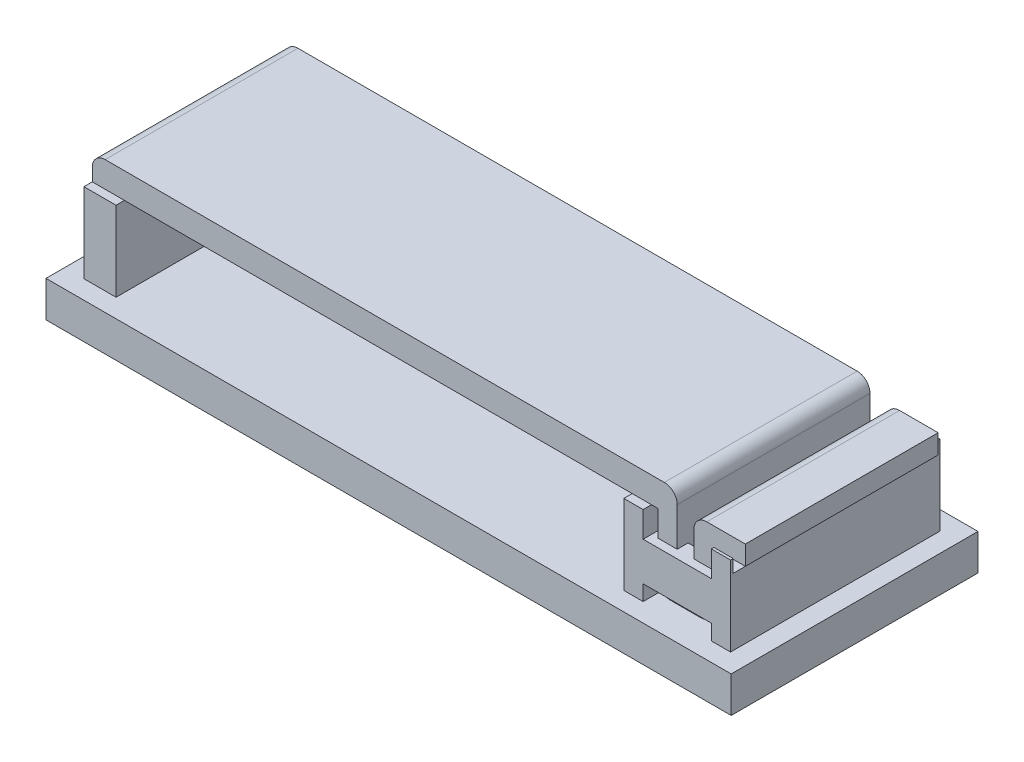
ISO-10303-21;
HEADER;
FILE_DESCRIPTION(('STEP AP214'),'2;1');
FILE_NAME('part.step','',(''),(''),'','','');
FILE_SCHEMA(('AUTOMOTIVE_DESIGN { 1 0 10303 214 1 1 1 1 }'));
ENDSEC;
DATA;
#1=APPLICATION_CONTEXT('core data for automotive mechanical design processes');
#2=APPLICATION_PROTOCOL_DEFINITION('international standard','automotive_design',2000,#1);
#3=PRODUCT_CONTEXT('',#1,'mechanical');
#4=PRODUCT('Part','Part','',(#3));
#5=PRODUCT_RELATED_PRODUCT_CATEGORY('part','',(#4));
#6=PRODUCT_DEFINITION_FORMATION('','',#4);
#7=PRODUCT_DEFINITION_CONTEXT('part definition',#1,'design');
#8=PRODUCT_DEFINITION('design','',#6,#7);
#9=PRODUCT_DEFINITION_SHAPE('','',#8);
#10=(LENGTH_UNIT() NAMED_UNIT(*) SI_UNIT(.MILLI.,.METRE.));
#11=(NAMED_UNIT(*) PLANE_ANGLE_UNIT() SI_UNIT($,.RADIAN.));
#12=(NAMED_UNIT(*) SI_UNIT($,.STERADIAN.) SOLID_ANGLE_UNIT());
#13=UNCERTAINTY_MEASURE_WITH_UNIT(LENGTH_MEASURE(1.E-05),#10,'distance_accuracy_value','');
#14=(GEOMETRIC_REPRESENTATION_CONTEXT(3) GLOBAL_UNCERTAINTY_ASSIGNED_CONTEXT((#13)) GLOBAL_UNIT_ASSIGNED_CONTEXT((#10,
#11,#12)) REPRESENTATION_CONTEXT('',''));
#15=CARTESIAN_POINT('',(0.,0.,0.));
#16=DIRECTION('',(0.,0.,1.));
#17=DIRECTION('',(1.,0.,0.));
#18=AXIS2_PLACEMENT_3D('',#15,#16,#17);
#19=CARTESIAN_POINT('',(18.35,7.,-9.601));
#20=DIRECTION('',(0.,-1.,0.));
#21=DIRECTION('',(0.,0.,-1.));
#22=AXIS2_PLACEMENT_3D('',#19,#20,#21);
#23=PLANE('',#22);
#24=DIRECTION('',(0.,0.,1.));
#25=VECTOR('',#24,1.);
#26=CARTESIAN_POINT('',(18.85,7.,-9.601));
#27=LINE('',#26,#25);
#28=CARTESIAN_POINT('',(18.85,7.,6.65));
#29=VERTEX_POINT('',#28);
#30=CARTESIAN_POINT('',(18.85,7.,7.5));
#31=VERTEX_POINT('',#30);
#32=EDGE_CURVE('E693',#29,#31,#27,.T.);
#33=ORIENTED_EDGE('',*,*,#32,.F.);
#34=DIRECTION('',(1.,0.,0.));
#35=VECTOR('',#34,1.);
#36=CARTESIAN_POINT('',(18.35,7.,6.65));
#37=LINE('',#36,#35);
#38=CARTESIAN_POINT('',(18.35,7.,6.65));
#39=VERTEX_POINT('',#38);
#40=EDGE_CURVE('E736',#39,#29,#37,.T.);
#41=ORIENTED_EDGE('',*,*,#40,.F.);
#42=DIRECTION('',(0.,0.,1.));
#43=VECTOR('',#42,1.);
#44=CARTESIAN_POINT('',(18.35,7.,-9.601));
#45=LINE('',#44,#43);
#46=CARTESIAN_POINT('',(18.35,7.,8.15));
#47=VERTEX_POINT('',#46);
#48=EDGE_CURVE('E799',#39,#47,#45,.T.);
#49=ORIENTED_EDGE('',*,*,#48,.T.);
#50=DIRECTION('',(1.,0.,0.));
#51=VECTOR('',#50,1.);
#52=CARTESIAN_POINT('',(18.35,7.,8.15));
#53=LINE('',#52,#51);
#54=CARTESIAN_POINT('',(23.65,7.,8.15));
#55=VERTEX_POINT('',#54);
#56=EDGE_CURVE('E793',#47,#55,#53,.T.);
#57=ORIENTED_EDGE('',*,*,#56,.T.);
#58=DIRECTION('',(0.,0.,1.));
#59=VECTOR('',#58,1.);
#60=CARTESIAN_POINT('',(23.65,7.,-9.601));
#61=LINE('',#60,#59);
#62=CARTESIAN_POINT('',(23.65,7.,6.65));
#63=VERTEX_POINT('',#62);
#64=EDGE_CURVE('E813',#63,#55,#61,.T.);
#65=ORIENTED_EDGE('',*,*,#64,.F.);
#66=CARTESIAN_POINT('',(23.15,7.,6.65));
#67=VERTEX_POINT('',#66);
#68=EDGE_CURVE('E735',#67,#63,#37,.T.);
#69=ORIENTED_EDGE('',*,*,#68,.F.);
#70=DIRECTION('',(0.,0.,-1.));
#71=VECTOR('',#70,1.);
#72=CARTESIAN_POINT('',(23.15,7.,-9.601));
#73=LINE('',#72,#71);
#74=CARTESIAN_POINT('',(23.15,7.,7.5));
#75=VERTEX_POINT('',#74);
#76=EDGE_CURVE('E685',#75,#67,#73,.T.);
#77=ORIENTED_EDGE('',*,*,#76,.F.);
#78=DIRECTION('',(1.,0.,0.));
#79=VECTOR('',#78,1.);
#80=CARTESIAN_POINT('',(18.35,7.,7.5));
#81=LINE('',#80,#79);
#82=CARTESIAN_POINT('',(21.65,7.,7.5));
#83=VERTEX_POINT('',#82);
#84=EDGE_CURVE('E702',#83,#75,#81,.T.);
#85=ORIENTED_EDGE('',*,*,#84,.F.);
#86=DIRECTION('',(0.,0.,1.));
#87=VECTOR('',#86,1.);
#88=CARTESIAN_POINT('',(21.65,7.,-9.601));
#89=LINE('',#88,#87);
#90=CARTESIAN_POINT('',(21.65,7.,6.65));
#91=VERTEX_POINT('',#90);
#92=EDGE_CURVE('E679',#91,#83,#89,.T.);
#93=ORIENTED_EDGE('',*,*,#92,.F.);
#94=CARTESIAN_POINT('',(20.35,7.,6.65));
#95=VERTEX_POINT('',#94);
#96=EDGE_CURVE('E740',#95,#91,#37,.T.);
#97=ORIENTED_EDGE('',*,*,#96,.F.);
#98=DIRECTION('',(0.,0.,-1.));
#99=VECTOR('',#98,1.);
#100=CARTESIAN_POINT('',(20.35,7.,-9.601));
#101=LINE('',#100,#99);
#102=CARTESIAN_POINT('',(20.35,7.,7.5));
#103=VERTEX_POINT('',#102);
#104=EDGE_CURVE('E667',#103,#95,#101,.T.);
#105=ORIENTED_EDGE('',*,*,#104,.F.);
#106=EDGE_CURVE('E704',#31,#103,#81,.T.);
#107=ORIENTED_EDGE('',*,*,#106,.F.);
#108=EDGE_LOOP('',(#33,#41,#49,#57,#65,#69,#77,#85,#93,#97,#105,#107));
#109=FACE_BOUND('',#108,.T.);
#110=ADVANCED_FACE('F34',(#109),#23,.F.);
#111=CARTESIAN_POINT('',(18.35,4.,-9.601));
#112=DIRECTION('',(0.,1.,0.));
#113=DIRECTION('',(0.,0.,1.));
#114=AXIS2_PLACEMENT_3D('',#111,#112,#113);
#115=PLANE('',#114);
#116=DIRECTION('',(-1.,0.,0.));
#117=VECTOR('',#116,1.);
#118=CARTESIAN_POINT('',(18.35,4.,6.65));
#119=LINE('',#118,#117);
#120=CARTESIAN_POINT('',(18.896060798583,4.,6.65));
#121=VERTEX_POINT('',#120);
#122=CARTESIAN_POINT('',(18.35,4.,6.65));
#123=VERTEX_POINT('',#122);
#124=EDGE_CURVE('E49',#121,#123,#119,.T.);
#125=ORIENTED_EDGE('',*,*,#124,.F.);
#126=DIRECTION('',(0.,0.,-1.));
#127=VECTOR('',#126,1.);
#128=CARTESIAN_POINT('',(18.896060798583,4.,6.65));
#129=LINE('',#128,#127);
#130=CARTESIAN_POINT('',(18.896060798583,4.,7.5));
#131=VERTEX_POINT('',#130);
#132=EDGE_CURVE('E569',#121,#131,#129,.F.);
#133=ORIENTED_EDGE('',*,*,#132,.T.);
#134=DIRECTION('',(-1.,0.,0.));
#135=VECTOR('',#134,1.);
#136=CARTESIAN_POINT('',(18.35,4.,7.5));
#137=LINE('',#136,#135);
#138=CARTESIAN_POINT('',(23.1039392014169,4.,7.5));
#139=VERTEX_POINT('',#138);
#140=EDGE_CURVE('E699',#139,#131,#137,.T.);
#141=ORIENTED_EDGE('',*,*,#140,.F.);
#142=DIRECTION('',(0.,0.,-1.));
#143=VECTOR('',#142,1.);
#144=CARTESIAN_POINT('',(23.1039392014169,4.,7.5));
#145=LINE('',#144,#143);
#146=CARTESIAN_POINT('',(23.1039392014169,4.,6.65));
#147=VERTEX_POINT('',#146);
#148=EDGE_CURVE('E558',#139,#147,#145,.T.);
#149=ORIENTED_EDGE('',*,*,#148,.T.);
#150=CARTESIAN_POINT('',(23.65,4.,6.65));
#151=VERTEX_POINT('',#150);
#152=EDGE_CURVE('E755',#151,#147,#119,.T.);
#153=ORIENTED_EDGE('',*,*,#152,.F.);
#154=DIRECTION('',(0.,0.,1.));
#155=VECTOR('',#154,1.);
#156=CARTESIAN_POINT('',(23.65,4.,-9.601));
#157=LINE('',#156,#155);
#158=CARTESIAN_POINT('',(23.65,4.,8.15));
#159=VERTEX_POINT('',#158);
#160=EDGE_CURVE('E782',#151,#159,#157,.T.);
#161=ORIENTED_EDGE('',*,*,#160,.T.);
#162=DIRECTION('',(-1.,0.,0.));
#163=VECTOR('',#162,1.);
#164=CARTESIAN_POINT('',(18.35,4.,8.15));
#165=LINE('',#164,#163);
#166=CARTESIAN_POINT('',(18.35,4.,8.15));
#167=VERTEX_POINT('',#166);
#168=EDGE_CURVE('E770',#159,#167,#165,.T.);
#169=ORIENTED_EDGE('',*,*,#168,.T.);
#170=DIRECTION('',(0.,0.,1.));
#171=VECTOR('',#170,1.);
#172=CARTESIAN_POINT('',(18.35,4.,-9.601));
#173=LINE('',#172,#171);
#174=EDGE_CURVE('E778',#123,#167,#173,.T.);
#175=ORIENTED_EDGE('',*,*,#174,.F.);
#176=EDGE_LOOP('',(#125,#133,#141,#149,#153,#161,#169,#175));
#177=FACE_BOUND('',#176,.T.);
#178=ADVANCED_FACE('F921',(#177),#115,.F.);
#179=CARTESIAN_POINT('',(25.15,9.,8.15));
#180=DIRECTION('',(0.,-1.,0.));
#181=DIRECTION('',(1.,0.,0.));
#182=AXIS2_PLACEMENT_3D('',#179,#180,#181);
#183=PLANE('',#182);
#184=DIRECTION('',(1.,0.,0.));
#185=VECTOR('',#184,1.);
#186=CARTESIAN_POINT('',(-25.15,9.,7.5));
#187=LINE('',#186,#185);
#188=CARTESIAN_POINT('',(16.85,9.,7.5));
#189=VERTEX_POINT('',#188);
#190=CARTESIAN_POINT('',(18.35,9.,7.5));
#191=VERTEX_POINT('',#190);
#192=EDGE_CURVE('E977',#189,#191,#187,.T.);
#193=ORIENTED_EDGE('',*,*,#192,.F.);
#194=DIRECTION('',(0.,0.,-1.));
#195=VECTOR('',#194,1.);
#196=CARTESIAN_POINT('',(16.85,9.,8.15));
#197=LINE('',#196,#195);
#198=CARTESIAN_POINT('',(16.85,9.,8.15));
#199=VERTEX_POINT('',#198);
#200=EDGE_CURVE('E849',#199,#189,#197,.T.);
#201=ORIENTED_EDGE('',*,*,#200,.F.);
#202=DIRECTION('',(-1.,0.,0.));
#203=VECTOR('',#202,1.);
#204=CARTESIAN_POINT('',(25.15,9.,8.15));
#205=LINE('',#204,#203);
#206=CARTESIAN_POINT('',(18.35,9.,8.15));
#207=VERTEX_POINT('',#206);
#208=EDGE_CURVE('E826',#207,#199,#205,.T.);
#209=ORIENTED_EDGE('',*,*,#208,.F.);
#210=DIRECTION('',(0.,0.,1.));
#211=VECTOR('',#210,1.);
#212=CARTESIAN_POINT('',(18.35,9.,-9.601));
#213=LINE('',#212,#211);
#214=EDGE_CURVE('E805',#191,#207,#213,.T.);
#215=ORIENTED_EDGE('',*,*,#214,.F.);
#216=EDGE_LOOP('',(#193,#201,#209,#215));
#217=FACE_BOUND('',#216,.T.);
#218=ADVANCED_FACE('F919',(#217),#183,.F.);
#219=CARTESIAN_POINT('',(-25.15,9.,8.15));
#220=DIRECTION('',(0.,-1.,0.));
#221=DIRECTION('',(0.,0.,-1.));
#222=AXIS2_PLACEMENT_3D('',#219,#220,#221);
#223=PLANE('',#222);
#224=CARTESIAN_POINT('',(-25.15,9.,7.5));
#225=VERTEX_POINT('',#224);
#226=CARTESIAN_POINT('',(-22.65,9.,7.5));
#227=VERTEX_POINT('',#226);
#228=EDGE_CURVE('E421',#225,#227,#187,.T.);
#229=ORIENTED_EDGE('',*,*,#228,.F.);
#230=DIRECTION('',(0.,0.,-1.));
#231=VECTOR('',#230,1.);
#232=CARTESIAN_POINT('',(-25.15,9.,8.15));
#233=LINE('',#232,#231);
#234=CARTESIAN_POINT('',(-25.15,9.,8.15));
#235=VERTEX_POINT('',#234);
#236=EDGE_CURVE('E438',#235,#225,#233,.T.);
#237=ORIENTED_EDGE('',*,*,#236,.F.);
#238=DIRECTION('',(-1.,0.,0.));
#239=VECTOR('',#238,1.);
#240=CARTESIAN_POINT('',(-25.15,9.,8.15));
#241=LINE('',#240,#239);
#242=CARTESIAN_POINT('',(-22.65,9.,8.15));
#243=VERTEX_POINT('',#242);
#244=EDGE_CURVE('E866',#243,#235,#241,.T.);
#245=ORIENTED_EDGE('',*,*,#244,.F.);
#246=DIRECTION('',(0.,0.,-1.));
#247=VECTOR('',#246,1.);
#248=CARTESIAN_POINT('',(-22.65,9.,8.15));
#249=LINE('',#248,#247);
#250=EDGE_CURVE('E441',#243,#227,#249,.T.);
#251=ORIENTED_EDGE('',*,*,#250,.T.);
#252=EDGE_LOOP('',(#229,#237,#245,#251));
#253=FACE_BOUND('',#252,.T.);
#254=ADVANCED_FACE('F436',(#253),#223,.F.);
#255=DIRECTION('',(0.,0.,1.));
#256=VECTOR('',#255,1.);
#257=CARTESIAN_POINT('',(18.85,7.,-9.601));
#258=LINE('',#257,#256);
#259=CARTESIAN_POINT('',(18.85,7.,-7.5));
#260=VERTEX_POINT('',#259);
#261=CARTESIAN_POINT('',(18.85,7.,-6.65));
#262=VERTEX_POINT('',#261);
#263=EDGE_CURVE('E688',#260,#262,#258,.T.);
#264=ORIENTED_EDGE('',*,*,#263,.F.);
#265=DIRECTION('',(1.,0.,0.));
#266=VECTOR('',#265,1.);
#267=CARTESIAN_POINT('',(18.35,7.,-7.5));
#268=LINE('',#267,#266);
#269=CARTESIAN_POINT('',(20.35,7.,-7.5));
#270=VERTEX_POINT('',#269);
#271=EDGE_CURVE('E698',#260,#270,#268,.T.);
#272=ORIENTED_EDGE('',*,*,#271,.T.);
#273=DIRECTION('',(0.,0.,-1.));
#274=VECTOR('',#273,1.);
#275=CARTESIAN_POINT('',(20.35,7.,-9.601));
#276=LINE('',#275,#274);
#277=CARTESIAN_POINT('',(20.35,7.,-6.65));
#278=VERTEX_POINT('',#277);
#279=EDGE_CURVE('E661',#278,#270,#276,.T.);
#280=ORIENTED_EDGE('',*,*,#279,.F.);
#281=DIRECTION('',(-1.,0.,0.));
#282=VECTOR('',#281,1.);
#283=CARTESIAN_POINT('',(18.35,7.,-6.65));
#284=LINE('',#283,#282);
#285=CARTESIAN_POINT('',(21.65,7.,-6.65));
#286=VERTEX_POINT('',#285);
#287=EDGE_CURVE('E745',#286,#278,#284,.T.);
#288=ORIENTED_EDGE('',*,*,#287,.F.);
#289=DIRECTION('',(0.,0.,1.));
#290=VECTOR('',#289,1.);
#291=CARTESIAN_POINT('',(21.65,7.,-9.601));
#292=LINE('',#291,#290);
#293=CARTESIAN_POINT('',(21.65,7.,-7.5));
#294=VERTEX_POINT('',#293);
#295=EDGE_CURVE('E673',#294,#286,#292,.T.);
#296=ORIENTED_EDGE('',*,*,#295,.F.);
#297=CARTESIAN_POINT('',(23.15,7.,-7.5));
#298=VERTEX_POINT('',#297);
#299=EDGE_CURVE('E696',#294,#298,#268,.T.);
#300=ORIENTED_EDGE('',*,*,#299,.T.);
#301=DIRECTION('',(0.,0.,-1.));
#302=VECTOR('',#301,1.);
#303=CARTESIAN_POINT('',(23.15,7.,-9.601));
#304=LINE('',#303,#302);
#305=CARTESIAN_POINT('',(23.15,7.,-6.65));
#306=VERTEX_POINT('',#305);
#307=EDGE_CURVE('E590',#306,#298,#304,.T.);
#308=ORIENTED_EDGE('',*,*,#307,.F.);
#309=CARTESIAN_POINT('',(23.65,7.,-6.65));
#310=VERTEX_POINT('',#309);
#311=EDGE_CURVE('E741',#310,#306,#284,.T.);
#312=ORIENTED_EDGE('',*,*,#311,.F.);
#313=CARTESIAN_POINT('',(23.65,7.,-8.15));
#314=VERTEX_POINT('',#313);
#315=EDGE_CURVE('E810',#314,#310,#61,.T.);
#316=ORIENTED_EDGE('',*,*,#315,.F.);
#317=DIRECTION('',(-1.,0.,0.));
#318=VECTOR('',#317,1.);
#319=CARTESIAN_POINT('',(18.35,7.,-8.15));
#320=LINE('',#319,#318);
#321=CARTESIAN_POINT('',(18.35,7.,-8.15));
#322=VERTEX_POINT('',#321);
#323=EDGE_CURVE('E803',#314,#322,#320,.T.);
#324=ORIENTED_EDGE('',*,*,#323,.T.);
#325=CARTESIAN_POINT('',(18.35,7.,-6.65));
#326=VERTEX_POINT('',#325);
#327=EDGE_CURVE('E814',#322,#326,#45,.T.);
#328=ORIENTED_EDGE('',*,*,#327,.T.);
#329=EDGE_CURVE('E739',#262,#326,#284,.T.);
#330=ORIENTED_EDGE('',*,*,#329,.F.);
#331=EDGE_LOOP('',(#264,#272,#280,#288,#296,#300,#308,#312,#316,#324,#328,#330));
#332=FACE_BOUND('',#331,.T.);
#333=ADVANCED_FACE('F918',(#332),#23,.F.);
#334=DIRECTION('',(-1.,0.,0.));
#335=VECTOR('',#334,1.);
#336=CARTESIAN_POINT('',(18.35,4.,-7.5));
#337=LINE('',#336,#335);
#338=CARTESIAN_POINT('',(23.1039392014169,4.,-7.5));
#339=VERTEX_POINT('',#338);
#340=CARTESIAN_POINT('',(18.896060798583,4.,-7.5));
#341=VERTEX_POINT('',#340);
#342=EDGE_CURVE('E502',#339,#341,#337,.T.);
#343=ORIENTED_EDGE('',*,*,#342,.T.);
#344=DIRECTION('',(0.,0.,-1.));
#345=VECTOR('',#344,1.);
#346=CARTESIAN_POINT('',(18.896060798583,4.,-7.5));
#347=LINE('',#346,#345);
#348=CARTESIAN_POINT('',(18.896060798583,4.,-6.65));
#349=VERTEX_POINT('',#348);
#350=EDGE_CURVE('E563',#341,#349,#347,.F.);
#351=ORIENTED_EDGE('',*,*,#350,.T.);
#352=DIRECTION('',(1.,0.,0.));
#353=VECTOR('',#352,1.);
#354=CARTESIAN_POINT('',(18.35,4.,-6.65));
#355=LINE('',#354,#353);
#356=CARTESIAN_POINT('',(18.35,4.,-6.65));
#357=VERTEX_POINT('',#356);
#358=EDGE_CURVE('E57',#357,#349,#355,.T.);
#359=ORIENTED_EDGE('',*,*,#358,.F.);
#360=CARTESIAN_POINT('',(18.35,4.,-8.15));
#361=VERTEX_POINT('',#360);
#362=EDGE_CURVE('E774',#361,#357,#173,.T.);
#363=ORIENTED_EDGE('',*,*,#362,.F.);
#364=DIRECTION('',(1.,0.,0.));
#365=VECTOR('',#364,1.);
#366=CARTESIAN_POINT('',(18.35,4.,-8.15));
#367=LINE('',#366,#365);
#368=CARTESIAN_POINT('',(23.65,4.,-8.15));
#369=VERTEX_POINT('',#368);
#370=EDGE_CURVE('E759',#361,#369,#367,.T.);
#371=ORIENTED_EDGE('',*,*,#370,.T.);
#372=CARTESIAN_POINT('',(23.65,4.,-6.65));
#373=VERTEX_POINT('',#372);
#374=EDGE_CURVE('E779',#369,#373,#157,.T.);
#375=ORIENTED_EDGE('',*,*,#374,.T.);
#376=CARTESIAN_POINT('',(23.1039392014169,4.,-6.65));
#377=VERTEX_POINT('',#376);
#378=EDGE_CURVE('E727',#377,#373,#355,.T.);
#379=ORIENTED_EDGE('',*,*,#378,.F.);
#380=DIRECTION('',(0.,0.,-1.));
#381=VECTOR('',#380,1.);
#382=CARTESIAN_POINT('',(23.1039392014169,4.,-6.65));
#383=LINE('',#382,#381);
#384=EDGE_CURVE('E556',#377,#339,#383,.T.);
#385=ORIENTED_EDGE('',*,*,#384,.T.);
#386=EDGE_LOOP('',(#343,#351,#359,#363,#371,#375,#379,#385));
#387=FACE_BOUND('',#386,.T.);
#388=ADVANCED_FACE('F928',(#387),#115,.F.);
#389=CARTESIAN_POINT('',(18.35,-0.00100000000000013,6.65));
#390=DIRECTION('',(0.,0.,1.));
#391=DIRECTION('',(1.,0.,0.));
#392=AXIS2_PLACEMENT_3D('',#389,#390,#391);
#393=PLANE('',#392);
#394=DIRECTION('',(0.,1.,0.));
#395=VECTOR('',#394,1.);
#396=CARTESIAN_POINT('',(18.85,-0.00100000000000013,6.65));
#397=LINE('',#396,#395);
#398=CARTESIAN_POINT('',(18.85,4.3,6.65));
#399=VERTEX_POINT('',#398);
#400=EDGE_CURVE('E691',#399,#29,#397,.T.);
#401=ORIENTED_EDGE('',*,*,#400,.F.);
#402=CARTESIAN_POINT('',(19.85,4.3,6.65));
#403=DIRECTION('',(0.,0.,1.));
#404=DIRECTION('',(1.,0.,0.));
#405=AXIS2_PLACEMENT_3D('',#402,#403,#404);
#406=CIRCLE('',#405,1.);
#407=EDGE_CURVE('E567',#399,#121,#406,.T.);
#408=ORIENTED_EDGE('',*,*,#407,.T.);
#409=ORIENTED_EDGE('',*,*,#124,.T.);
#410=DIRECTION('',(0.,1.,0.));
#411=VECTOR('',#410,1.);
#412=CARTESIAN_POINT('',(18.35,-0.00100000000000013,6.65));
#413=LINE('',#412,#411);
#414=EDGE_CURVE('E744',#123,#39,#413,.T.);
#415=ORIENTED_EDGE('',*,*,#414,.T.);
#416=ORIENTED_EDGE('',*,*,#40,.T.);
#417=EDGE_LOOP('',(#401,#408,#409,#415,#416));
#418=FACE_BOUND('',#417,.T.);
#419=ADVANCED_FACE('F937',(#418),#393,.F.);
#420=DIRECTION('',(0.,-1.,0.));
#421=VECTOR('',#420,1.);
#422=CARTESIAN_POINT('',(23.15,-0.00100000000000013,6.65));
#423=LINE('',#422,#421);
#424=CARTESIAN_POINT('',(23.15,4.3,6.65));
#425=VERTEX_POINT('',#424);
#426=EDGE_CURVE('E683',#67,#425,#423,.T.);
#427=ORIENTED_EDGE('',*,*,#426,.F.);
#428=ORIENTED_EDGE('',*,*,#68,.T.);
#429=DIRECTION('',(0.,1.,0.));
#430=VECTOR('',#429,1.);
#431=CARTESIAN_POINT('',(23.65,-0.00100000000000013,6.65));
#432=LINE('',#431,#430);
#433=EDGE_CURVE('E751',#151,#63,#432,.T.);
#434=ORIENTED_EDGE('',*,*,#433,.F.);
#435=ORIENTED_EDGE('',*,*,#152,.T.);
#436=CARTESIAN_POINT('',(22.15,4.3,6.65));
#437=DIRECTION('',(0.,0.,1.));
#438=DIRECTION('',(1.,0.,0.));
#439=AXIS2_PLACEMENT_3D('',#436,#437,#438);
#440=CIRCLE('',#439,1.);
#441=EDGE_CURVE('E561',#147,#425,#440,.T.);
#442=ORIENTED_EDGE('',*,*,#441,.T.);
#443=EDGE_LOOP('',(#427,#428,#434,#435,#442));
#444=FACE_BOUND('',#443,.T.);
#445=ADVANCED_FACE('F1072',(#444),#393,.F.);
#446=DIRECTION('',(0.,1.,0.));
#447=VECTOR('',#446,1.);
#448=CARTESIAN_POINT('',(21.65,-0.00100000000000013,6.65));
#449=LINE('',#448,#447);
#450=CARTESIAN_POINT('',(21.65,4.8,6.65));
#451=VERTEX_POINT('',#450);
#452=EDGE_CURVE('E676',#451,#91,#449,.T.);
#453=ORIENTED_EDGE('',*,*,#452,.F.);
#454=DIRECTION('',(1.,0.,0.));
#455=VECTOR('',#454,1.);
#456=CARTESIAN_POINT('',(18.35,4.8,6.65));
#457=LINE('',#456,#455);
#458=CARTESIAN_POINT('',(20.35,4.8,6.65));
#459=VERTEX_POINT('',#458);
#460=EDGE_CURVE('E670',#459,#451,#457,.T.);
#461=ORIENTED_EDGE('',*,*,#460,.F.);
#462=DIRECTION('',(0.,-1.,0.));
#463=VECTOR('',#462,1.);
#464=CARTESIAN_POINT('',(20.35,-0.00100000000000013,6.65));
#465=LINE('',#464,#463);
#466=EDGE_CURVE('E664',#95,#459,#465,.T.);
#467=ORIENTED_EDGE('',*,*,#466,.F.);
#468=ORIENTED_EDGE('',*,*,#96,.T.);
#469=EDGE_LOOP('',(#453,#461,#467,#468));
#470=FACE_BOUND('',#469,.T.);
#471=ADVANCED_FACE('F1069',(#470),#393,.F.);
#472=CARTESIAN_POINT('',(18.35,-0.00100000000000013,-6.65));
#473=DIRECTION('',(0.,0.,-1.));
#474=DIRECTION('',(-1.,0.,0.));
#475=AXIS2_PLACEMENT_3D('',#472,#473,#474);
#476=PLANE('',#475);
#477=DIRECTION('',(0.,-1.,0.));
#478=VECTOR('',#477,1.);
#479=CARTESIAN_POINT('',(18.85,-0.00100000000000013,-6.65));
#480=LINE('',#479,#478);
#481=CARTESIAN_POINT('',(18.85,4.3,-6.65));
#482=VERTEX_POINT('',#481);
#483=EDGE_CURVE('E499',#262,#482,#480,.T.);
#484=ORIENTED_EDGE('',*,*,#483,.F.);
#485=ORIENTED_EDGE('',*,*,#329,.T.);
#486=DIRECTION('',(0.,1.,0.));
#487=VECTOR('',#486,1.);
#488=CARTESIAN_POINT('',(18.35,-0.00100000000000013,-6.65));
#489=LINE('',#488,#487);
#490=EDGE_CURVE('E746',#357,#326,#489,.T.);
#491=ORIENTED_EDGE('',*,*,#490,.F.);
#492=ORIENTED_EDGE('',*,*,#358,.T.);
#493=CARTESIAN_POINT('',(19.85,4.3,-6.65));
#494=DIRECTION('',(0.,0.,-1.));
#495=DIRECTION('',(-1.,0.,0.));
#496=AXIS2_PLACEMENT_3D('',#493,#494,#495);
#497=CIRCLE('',#496,1.);
#498=EDGE_CURVE('E565',#349,#482,#497,.T.);
#499=ORIENTED_EDGE('',*,*,#498,.T.);
#500=EDGE_LOOP('',(#484,#485,#491,#492,#499));
#501=FACE_BOUND('',#500,.T.);
#502=ADVANCED_FACE('F1066',(#501),#476,.F.);
#503=DIRECTION('',(0.,1.,0.));
#504=VECTOR('',#503,1.);
#505=CARTESIAN_POINT('',(23.15,-0.00100000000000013,-6.65));
#506=LINE('',#505,#504);
#507=CARTESIAN_POINT('',(23.15,4.3,-6.65));
#508=VERTEX_POINT('',#507);
#509=EDGE_CURVE('E497',#508,#306,#506,.T.);
#510=ORIENTED_EDGE('',*,*,#509,.F.);
#511=CARTESIAN_POINT('',(22.15,4.3,-6.65));
#512=DIRECTION('',(0.,0.,-1.));
#513=DIRECTION('',(-1.,0.,0.));
#514=AXIS2_PLACEMENT_3D('',#511,#512,#513);
#515=CIRCLE('',#514,1.);
#516=EDGE_CURVE('E553',#508,#377,#515,.T.);
#517=ORIENTED_EDGE('',*,*,#516,.T.);
#518=ORIENTED_EDGE('',*,*,#378,.T.);
#519=DIRECTION('',(0.,1.,0.));
#520=VECTOR('',#519,1.);
#521=CARTESIAN_POINT('',(23.65,-0.00100000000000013,-6.65));
#522=LINE('',#521,#520);
#523=EDGE_CURVE('E749',#373,#310,#522,.T.);
#524=ORIENTED_EDGE('',*,*,#523,.T.);
#525=ORIENTED_EDGE('',*,*,#311,.T.);
#526=EDGE_LOOP('',(#510,#517,#518,#524,#525));
#527=FACE_BOUND('',#526,.T.);
#528=ADVANCED_FACE('F1013',(#527),#476,.F.);
#529=DIRECTION('',(0.,-1.,0.));
#530=VECTOR('',#529,1.);
#531=CARTESIAN_POINT('',(21.65,-0.00100000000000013,-6.65));
#532=LINE('',#531,#530);
#533=CARTESIAN_POINT('',(21.65,4.8,-6.65));
#534=VERTEX_POINT('',#533);
#535=EDGE_CURVE('E494',#286,#534,#532,.T.);
#536=ORIENTED_EDGE('',*,*,#535,.F.);
#537=ORIENTED_EDGE('',*,*,#287,.T.);
#538=DIRECTION('',(0.,1.,0.));
#539=VECTOR('',#538,1.);
#540=CARTESIAN_POINT('',(20.35,-0.00100000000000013,-6.65));
#541=LINE('',#540,#539);
#542=CARTESIAN_POINT('',(20.35,4.8,-6.65));
#543=VERTEX_POINT('',#542);
#544=EDGE_CURVE('E488',#543,#278,#541,.T.);
#545=ORIENTED_EDGE('',*,*,#544,.F.);
#546=DIRECTION('',(-1.,0.,0.));
#547=VECTOR('',#546,1.);
#548=CARTESIAN_POINT('',(18.35,4.8,-6.65));
#549=LINE('',#548,#547);
#550=EDGE_CURVE('E491',#534,#543,#549,.T.);
#551=ORIENTED_EDGE('',*,*,#550,.F.);
#552=EDGE_LOOP('',(#536,#537,#545,#551));
#553=FACE_BOUND('',#552,.T.);
#554=ADVANCED_FACE('F1070',(#553),#476,.F.);
#555=DIRECTION('',(0.,0.,1.));
#556=VECTOR('',#555,1.);
#557=CARTESIAN_POINT('',(23.65,9.,-9.601));
#558=LINE('',#557,#556);
#559=CARTESIAN_POINT('',(23.65,9.,-8.15));
#560=VERTEX_POINT('',#559);
#561=CARTESIAN_POINT('',(23.65,9.,-7.95));
#562=VERTEX_POINT('',#561);
#563=EDGE_CURVE('E806',#560,#562,#558,.T.);
#564=ORIENTED_EDGE('',*,*,#563,.T.);
#565=DIRECTION('',(1.,0.,0.));
#566=VECTOR('',#565,1.);
#567=CARTESIAN_POINT('',(-26.651,9.,-7.95));
#568=LINE('',#567,#566);
#569=CARTESIAN_POINT('',(25.15,9.,-7.95));
#570=VERTEX_POINT('',#569);
#571=EDGE_CURVE('E730',#562,#570,#568,.T.);
#572=ORIENTED_EDGE('',*,*,#571,.T.);
#573=DIRECTION('',(0.,0.,-1.));
#574=VECTOR('',#573,1.);
#575=CARTESIAN_POINT('',(25.15,9.,8.15));
#576=LINE('',#575,#574);
#577=CARTESIAN_POINT('',(25.15,9.,-8.15));
#578=VERTEX_POINT('',#577);
#579=EDGE_CURVE('E852',#570,#578,#576,.T.);
#580=ORIENTED_EDGE('',*,*,#579,.T.);
#581=DIRECTION('',(-1.,0.,0.));
#582=VECTOR('',#581,1.);
#583=CARTESIAN_POINT('',(25.15,9.,-8.15));
#584=LINE('',#583,#582);
#585=EDGE_CURVE('E841',#578,#560,#584,.T.);
#586=ORIENTED_EDGE('',*,*,#585,.T.);
#587=EDGE_LOOP('',(#564,#572,#580,#586));
#588=FACE_BOUND('',#587,.T.);
#589=ADVANCED_FACE('F1093',(#588),#183,.F.);
#590=CARTESIAN_POINT('',(16.85,9.,-7.5));
#591=VERTEX_POINT('',#590);
#592=CARTESIAN_POINT('',(16.85,9.,-8.15));
#593=VERTEX_POINT('',#592);
#594=EDGE_CURVE('E848',#591,#593,#197,.T.);
#595=ORIENTED_EDGE('',*,*,#594,.F.);
#596=DIRECTION('',(1.,0.,0.));
#597=VECTOR('',#596,1.);
#598=CARTESIAN_POINT('',(-25.15,9.,-7.5));
#599=LINE('',#598,#597);
#600=CARTESIAN_POINT('',(18.35,9.,-7.5));
#601=VERTEX_POINT('',#600);
#602=EDGE_CURVE('E905',#591,#601,#599,.T.);
#603=ORIENTED_EDGE('',*,*,#602,.T.);
#604=CARTESIAN_POINT('',(18.35,9.,-8.15));
#605=VERTEX_POINT('',#604);
#606=EDGE_CURVE('E800',#605,#601,#213,.T.);
#607=ORIENTED_EDGE('',*,*,#606,.F.);
#608=EDGE_CURVE('E840',#605,#593,#584,.T.);
#609=ORIENTED_EDGE('',*,*,#608,.T.);
#610=EDGE_LOOP('',(#595,#603,#607,#609));
#611=FACE_BOUND('',#610,.T.);
#612=ADVANCED_FACE('F956',(#611),#183,.F.);
#613=CARTESIAN_POINT('',(-26.65,2.8,-9.6));
#614=DIRECTION('',(0.,-1.,0.));
#615=DIRECTION('',(0.,0.,-1.));
#616=AXIS2_PLACEMENT_3D('',#613,#614,#615);
#617=PLANE('',#616);
#618=DIRECTION('',(1.,0.,0.));
#619=VECTOR('',#618,1.);
#620=CARTESIAN_POINT('',(16.85,2.8,8.15));
#621=LINE('',#620,#619);
#622=CARTESIAN_POINT('',(23.65,2.8,8.15));
#623=VERTEX_POINT('',#622);
#624=CARTESIAN_POINT('',(25.15,2.8,8.15));
#625=VERTEX_POINT('',#624);
#626=EDGE_CURVE('E824',#623,#625,#621,.T.);
#627=ORIENTED_EDGE('',*,*,#626,.F.);
#628=DIRECTION('',(0.,0.,1.));
#629=VECTOR('',#628,1.);
#630=CARTESIAN_POINT('',(23.65,2.8,-9.601));
#631=LINE('',#630,#629);
#632=CARTESIAN_POINT('',(23.65,2.8,-8.15));
#633=VERTEX_POINT('',#632);
#634=EDGE_CURVE('E783',#633,#623,#631,.T.);
#635=ORIENTED_EDGE('',*,*,#634,.F.);
#636=DIRECTION('',(1.,0.,0.));
#637=VECTOR('',#636,1.);
#638=CARTESIAN_POINT('',(16.85,2.8,-8.15));
#639=LINE('',#638,#637);
#640=CARTESIAN_POINT('',(25.15,2.8,-8.15));
#641=VERTEX_POINT('',#640);
#642=EDGE_CURVE('E819',#633,#641,#639,.T.);
#643=ORIENTED_EDGE('',*,*,#642,.T.);
#644=DIRECTION('',(0.,0.,-1.));
#645=VECTOR('',#644,1.);
#646=CARTESIAN_POINT('',(25.15,2.8,8.15));
#647=LINE('',#646,#645);
#648=EDGE_CURVE('E856',#625,#641,#647,.T.);
#649=ORIENTED_EDGE('',*,*,#648,.F.);
#650=EDGE_LOOP('',(#627,#635,#643,#649));
#651=FACE_BOUND('',#650,.T.);
#652=DIRECTION('',(0.,0.,1.));
#653=VECTOR('',#652,1.);
#654=CARTESIAN_POINT('',(18.35,2.8,-9.601));
#655=LINE('',#654,#653);
#656=CARTESIAN_POINT('',(18.35,2.8,-8.15));
#657=VERTEX_POINT('',#656);
#658=CARTESIAN_POINT('',(18.35,2.8,8.15));
#659=VERTEX_POINT('',#658);
#660=EDGE_CURVE('E773',#657,#659,#655,.T.);
#661=ORIENTED_EDGE('',*,*,#660,.T.);
#662=CARTESIAN_POINT('',(16.85,2.8,8.15));
#663=VERTEX_POINT('',#662);
#664=EDGE_CURVE('E820',#663,#659,#621,.T.);
#665=ORIENTED_EDGE('',*,*,#664,.F.);
#666=DIRECTION('',(0.,0.,-1.));
#667=VECTOR('',#666,1.);
#668=CARTESIAN_POINT('',(16.85,2.8,8.15));
#669=LINE('',#668,#667);
#670=CARTESIAN_POINT('',(16.85,2.8,-8.15));
#671=VERTEX_POINT('',#670);
#672=EDGE_CURVE('E833',#663,#671,#669,.T.);
#673=ORIENTED_EDGE('',*,*,#672,.T.);
#674=EDGE_CURVE('E834',#671,#657,#639,.T.);
#675=ORIENTED_EDGE('',*,*,#674,.T.);
#676=EDGE_LOOP('',(#661,#665,#673,#675));
#677=FACE_BOUND('',#676,.T.);
#678=DIRECTION('',(0.,0.,1.));
#679=VECTOR('',#678,1.);
#680=CARTESIAN_POINT('',(-26.65,2.8,9.6));
#681=LINE('',#680,#679);
#682=CARTESIAN_POINT('',(-26.65,2.8,-9.6));
#683=VERTEX_POINT('',#682);
#684=CARTESIAN_POINT('',(-26.65,2.8,9.6));
#685=VERTEX_POINT('',#684);
#686=EDGE_CURVE('E459',#683,#685,#681,.T.);
#687=ORIENTED_EDGE('',*,*,#686,.T.);
#688=DIRECTION('',(1.,0.,0.));
#689=VECTOR('',#688,1.);
#690=CARTESIAN_POINT('',(-26.65,2.8,9.6));
#691=LINE('',#690,#689);
#692=CARTESIAN_POINT('',(26.65,2.8,9.6));
#693=VERTEX_POINT('',#692);
#694=EDGE_CURVE('E462',#685,#693,#691,.T.);
#695=ORIENTED_EDGE('',*,*,#694,.T.);
#696=DIRECTION('',(0.,0.,-1.));
#697=VECTOR('',#696,1.);
#698=CARTESIAN_POINT('',(26.65,2.8,9.6));
#699=LINE('',#698,#697);
#700=CARTESIAN_POINT('',(26.65,2.8,-9.6));
#701=VERTEX_POINT('',#700);
#702=EDGE_CURVE('E465',#693,#701,#699,.T.);
#703=ORIENTED_EDGE('',*,*,#702,.T.);
#704=DIRECTION('',(-1.,0.,0.));
#705=VECTOR('',#704,1.);
#706=CARTESIAN_POINT('',(-26.65,2.8,-9.6));
#707=LINE('',#706,#705);
#708=EDGE_CURVE('E467',#701,#683,#707,.T.);
#709=ORIENTED_EDGE('',*,*,#708,.T.);
#710=EDGE_LOOP('',(#687,#695,#703,#709));
#711=FACE_BOUND('',#710,.T.);
#712=DIRECTION('',(1.,0.,0.));
#713=VECTOR('',#712,1.);
#714=CARTESIAN_POINT('',(-25.15,2.8,8.15));
#715=LINE('',#714,#713);
#716=CARTESIAN_POINT('',(-25.15,2.8,8.15));
#717=VERTEX_POINT('',#716);
#718=CARTESIAN_POINT('',(-22.65,2.8,8.15));
#719=VERTEX_POINT('',#718);
#720=EDGE_CURVE('E860',#717,#719,#715,.T.);
#721=ORIENTED_EDGE('',*,*,#720,.F.);
#722=DIRECTION('',(0.,0.,-1.));
#723=VECTOR('',#722,1.);
#724=CARTESIAN_POINT('',(-25.15,2.8,8.15));
#725=LINE('',#724,#723);
#726=CARTESIAN_POINT('',(-25.15,2.8,-8.15));
#727=VERTEX_POINT('',#726);
#728=EDGE_CURVE('E452',#717,#727,#725,.T.);
#729=ORIENTED_EDGE('',*,*,#728,.T.);
#730=DIRECTION('',(1.,0.,0.));
#731=VECTOR('',#730,1.);
#732=CARTESIAN_POINT('',(-25.15,2.8,-8.15));
#733=LINE('',#732,#731);
#734=CARTESIAN_POINT('',(-22.65,2.8,-8.15));
#735=VERTEX_POINT('',#734);
#736=EDGE_CURVE('E859',#727,#735,#733,.T.);
#737=ORIENTED_EDGE('',*,*,#736,.T.);
#738=DIRECTION('',(0.,0.,-1.));
#739=VECTOR('',#738,1.);
#740=CARTESIAN_POINT('',(-22.65,2.8,8.15));
#741=LINE('',#740,#739);
#742=EDGE_CURVE('E456',#719,#735,#741,.T.);
#743=ORIENTED_EDGE('',*,*,#742,.F.);
#744=EDGE_LOOP('',(#721,#729,#737,#743));
#745=FACE_BOUND('',#744,.T.);
#746=ADVANCED_FACE('F887',(#651,#677,#711,#745),#617,.F.);
#747=CARTESIAN_POINT('',(-26.65,2.8,9.6));
#748=DIRECTION('',(1.,0.,0.));
#749=DIRECTION('',(0.,0.,-1.));
#750=AXIS2_PLACEMENT_3D('',#747,#748,#749);
#751=PLANE('',#750);
#752=DIRECTION('',(0.,0.,1.));
#753=VECTOR('',#752,1.);
#754=CARTESIAN_POINT('',(-26.65,0.,9.6));
#755=LINE('',#754,#753);
#756=CARTESIAN_POINT('',(-26.65,0.,-9.6));
#757=VERTEX_POINT('',#756);
#758=CARTESIAN_POINT('',(-26.65,0.,9.6));
#759=VERTEX_POINT('',#758);
#760=EDGE_CURVE('E458',#757,#759,#755,.T.);
#761=ORIENTED_EDGE('',*,*,#760,.T.);
#762=DIRECTION('',(0.,-1.,0.));
#763=VECTOR('',#762,1.);
#764=CARTESIAN_POINT('',(-26.65,2.8,9.6));
#765=LINE('',#764,#763);
#766=EDGE_CURVE('E485',#685,#759,#765,.T.);
#767=ORIENTED_EDGE('',*,*,#766,.F.);
#768=ORIENTED_EDGE('',*,*,#686,.F.);
#769=DIRECTION('',(0.,-1.,0.));
#770=VECTOR('',#769,1.);
#771=CARTESIAN_POINT('',(-26.65,2.8,-9.6));
#772=LINE('',#771,#770);
#773=EDGE_CURVE('E469',#683,#757,#772,.T.);
#774=ORIENTED_EDGE('',*,*,#773,.T.);
#775=EDGE_LOOP('',(#761,#767,#768,#774));
#776=FACE_BOUND('',#775,.T.);
#777=ADVANCED_FACE('F1134',(#776),#751,.F.);
#778=CARTESIAN_POINT('',(-26.65,2.8,9.6));
#779=DIRECTION('',(0.,0.,-1.));
#780=DIRECTION('',(-1.,0.,0.));
#781=AXIS2_PLACEMENT_3D('',#778,#779,#780);
#782=PLANE('',#781);
#783=DIRECTION('',(1.,0.,0.));
#784=VECTOR('',#783,1.);
#785=CARTESIAN_POINT('',(-26.65,0.,9.6));
#786=LINE('',#785,#784);
#787=CARTESIAN_POINT('',(26.65,0.,9.6));
#788=VERTEX_POINT('',#787);
#789=EDGE_CURVE('E472',#759,#788,#786,.T.);
#790=ORIENTED_EDGE('',*,*,#789,.T.);
#791=DIRECTION('',(0.,-1.,0.));
#792=VECTOR('',#791,1.);
#793=CARTESIAN_POINT('',(26.65,2.8,9.6));
#794=LINE('',#793,#792);
#795=EDGE_CURVE('E482',#693,#788,#794,.T.);
#796=ORIENTED_EDGE('',*,*,#795,.F.);
#797=ORIENTED_EDGE('',*,*,#694,.F.);
#798=ORIENTED_EDGE('',*,*,#766,.T.);
#799=EDGE_LOOP('',(#790,#796,#797,#798));
#800=FACE_BOUND('',#799,.T.);
#801=ADVANCED_FACE('F1176',(#800),#782,.F.);
#802=CARTESIAN_POINT('',(26.65,2.8,9.6));
#803=DIRECTION('',(-1.,0.,0.));
#804=DIRECTION('',(0.,0.,1.));
#805=AXIS2_PLACEMENT_3D('',#802,#803,#804);
#806=PLANE('',#805);
#807=DIRECTION('',(0.,0.,-1.));
#808=VECTOR('',#807,1.);
#809=CARTESIAN_POINT('',(26.65,0.,9.6));
#810=LINE('',#809,#808);
#811=CARTESIAN_POINT('',(26.65,0.,-9.6));
#812=VERTEX_POINT('',#811);
#813=EDGE_CURVE('E474',#788,#812,#810,.T.);
#814=ORIENTED_EDGE('',*,*,#813,.T.);
#815=DIRECTION('',(0.,-1.,0.));
#816=VECTOR('',#815,1.);
#817=CARTESIAN_POINT('',(26.65,2.8,-9.6));
#818=LINE('',#817,#816);
#819=EDGE_CURVE('E479',#701,#812,#818,.T.);
#820=ORIENTED_EDGE('',*,*,#819,.F.);
#821=ORIENTED_EDGE('',*,*,#702,.F.);
#822=ORIENTED_EDGE('',*,*,#795,.T.);
#823=EDGE_LOOP('',(#814,#820,#821,#822));
#824=FACE_BOUND('',#823,.T.);
#825=ADVANCED_FACE('F1180',(#824),#806,.F.);
#826=CARTESIAN_POINT('',(-26.65,2.8,-9.6));
#827=DIRECTION('',(0.,0.,1.));
#828=DIRECTION('',(1.,0.,0.));
#829=AXIS2_PLACEMENT_3D('',#826,#827,#828);
#830=PLANE('',#829);
#831=DIRECTION('',(-1.,0.,0.));
#832=VECTOR('',#831,1.);
#833=CARTESIAN_POINT('',(-26.65,0.,-9.6));
#834=LINE('',#833,#832);
#835=EDGE_CURVE('E463',#812,#757,#834,.T.);
#836=ORIENTED_EDGE('',*,*,#835,.T.);
#837=ORIENTED_EDGE('',*,*,#773,.F.);
#838=ORIENTED_EDGE('',*,*,#708,.F.);
#839=ORIENTED_EDGE('',*,*,#819,.T.);
#840=EDGE_LOOP('',(#836,#837,#838,#839));
#841=FACE_BOUND('',#840,.T.);
#842=ADVANCED_FACE('F1184',(#841),#830,.F.);
#843=CARTESIAN_POINT('',(-26.65,0.,-9.6));
#844=DIRECTION('',(0.,-1.,0.));
#845=DIRECTION('',(0.,0.,-1.));
#846=AXIS2_PLACEMENT_3D('',#843,#844,#845);
#847=PLANE('',#846);
#848=ORIENTED_EDGE('',*,*,#760,.F.);
#849=ORIENTED_EDGE('',*,*,#835,.F.);
#850=ORIENTED_EDGE('',*,*,#813,.F.);
#851=ORIENTED_EDGE('',*,*,#789,.F.);
#852=EDGE_LOOP('',(#848,#849,#850,#851));
#853=FACE_BOUND('',#852,.T.);
#854=ADVANCED_FACE('F915',(#853),#847,.T.);
#855=CARTESIAN_POINT('',(-22.65,9.,8.15));
#856=DIRECTION('',(-1.,0.,0.));
#857=DIRECTION('',(0.,0.,1.));
#858=AXIS2_PLACEMENT_3D('',#855,#856,#857);
#859=PLANE('',#858);
#860=DIRECTION('',(0.,1.,0.));
#861=VECTOR('',#860,1.);
#862=CARTESIAN_POINT('',(-22.65,9.,-8.15));
#863=LINE('',#862,#861);
#864=CARTESIAN_POINT('',(-22.65,9.,-8.15));
#865=VERTEX_POINT('',#864);
#866=EDGE_CURVE('E871',#735,#865,#863,.T.);
#867=ORIENTED_EDGE('',*,*,#866,.T.);
#868=CARTESIAN_POINT('',(-22.65,9.,-7.5));
#869=VERTEX_POINT('',#868);
#870=EDGE_CURVE('E448',#869,#865,#249,.T.);
#871=ORIENTED_EDGE('',*,*,#870,.F.);
#872=DIRECTION('',(0.,0.,-1.));
#873=VECTOR('',#872,1.);
#874=CARTESIAN_POINT('',(-22.65,9.,8.15));
#875=LINE('',#874,#873);
#876=EDGE_CURVE('E707',#227,#869,#875,.T.);
#877=ORIENTED_EDGE('',*,*,#876,.F.);
#878=ORIENTED_EDGE('',*,*,#250,.F.);
#879=DIRECTION('',(0.,1.,0.));
#880=VECTOR('',#879,1.);
#881=CARTESIAN_POINT('',(-22.65,9.,8.15));
#882=LINE('',#881,#880);
#883=EDGE_CURVE('E863',#719,#243,#882,.T.);
#884=ORIENTED_EDGE('',*,*,#883,.F.);
#885=ORIENTED_EDGE('',*,*,#742,.T.);
#886=EDGE_LOOP('',(#867,#871,#877,#878,#884,#885));
#887=FACE_BOUND('',#886,.T.);
#888=ADVANCED_FACE('F891',(#887),#859,.F.);
#889=CARTESIAN_POINT('',(-25.15,9.,-7.5));
#890=VERTEX_POINT('',#889);
#891=CARTESIAN_POINT('',(-25.15,9.,-8.15));
#892=VERTEX_POINT('',#891);
#893=EDGE_CURVE('E449',#890,#892,#233,.T.);
#894=ORIENTED_EDGE('',*,*,#893,.F.);
#895=EDGE_CURVE('E627',#890,#869,#599,.T.);
#896=ORIENTED_EDGE('',*,*,#895,.T.);
#897=ORIENTED_EDGE('',*,*,#870,.T.);
#898=DIRECTION('',(-1.,0.,0.));
#899=VECTOR('',#898,1.);
#900=CARTESIAN_POINT('',(-25.15,9.,-8.15));
#901=LINE('',#900,#899);
#902=EDGE_CURVE('E874',#865,#892,#901,.T.);
#903=ORIENTED_EDGE('',*,*,#902,.T.);
#904=EDGE_LOOP('',(#894,#896,#897,#903));
#905=FACE_BOUND('',#904,.T.);
#906=ADVANCED_FACE('F907',(#905),#223,.F.);
#907=CARTESIAN_POINT('',(-25.15,2.8,8.15));
#908=DIRECTION('',(1.,0.,0.));
#909=DIRECTION('',(0.,0.,-1.));
#910=AXIS2_PLACEMENT_3D('',#907,#908,#909);
#911=PLANE('',#910);
#912=DIRECTION('',(0.,-1.,0.));
#913=VECTOR('',#912,1.);
#914=CARTESIAN_POINT('',(-25.15,9.,7.5));
#915=LINE('',#914,#913);
#916=CARTESIAN_POINT('',(-25.15,10.,7.5));
#917=VERTEX_POINT('',#916);
#918=EDGE_CURVE('E416',#917,#225,#915,.T.);
#919=ORIENTED_EDGE('',*,*,#918,.F.);
#920=DIRECTION('',(0.,0.,-1.));
#921=VECTOR('',#920,1.);
#922=CARTESIAN_POINT('',(-25.15,10.,8.15));
#923=LINE('',#922,#921);
#924=CARTESIAN_POINT('',(-25.15,10.,-7.5));
#925=VERTEX_POINT('',#924);
#926=EDGE_CURVE('E551',#917,#925,#923,.T.);
#927=ORIENTED_EDGE('',*,*,#926,.T.);
#928=DIRECTION('',(0.,-1.,0.));
#929=VECTOR('',#928,1.);
#930=CARTESIAN_POINT('',(-25.15,9.,-7.5));
#931=LINE('',#930,#929);
#932=EDGE_CURVE('E624',#925,#890,#931,.T.);
#933=ORIENTED_EDGE('',*,*,#932,.T.);
#934=ORIENTED_EDGE('',*,*,#893,.T.);
#935=DIRECTION('',(0.,-1.,0.));
#936=VECTOR('',#935,1.);
#937=CARTESIAN_POINT('',(-25.15,2.8,-8.15));
#938=LINE('',#937,#936);
#939=EDGE_CURVE('E864',#892,#727,#938,.T.);
#940=ORIENTED_EDGE('',*,*,#939,.T.);
#941=ORIENTED_EDGE('',*,*,#728,.F.);
#942=DIRECTION('',(0.,-1.,0.));
#943=VECTOR('',#942,1.);
#944=CARTESIAN_POINT('',(-25.15,2.8,8.15));
#945=LINE('',#944,#943);
#946=EDGE_CURVE('E447',#235,#717,#945,.T.);
#947=ORIENTED_EDGE('',*,*,#946,.F.);
#948=ORIENTED_EDGE('',*,*,#236,.T.);
#949=EDGE_LOOP('',(#919,#927,#933,#934,#940,#941,#947,#948));
#950=FACE_BOUND('',#949,.T.);
#951=ADVANCED_FACE('F445',(#950),#911,.F.);
#952=CARTESIAN_POINT('',(-22.65,2.8,8.15));
#953=DIRECTION('',(0.,0.,-1.));
#954=DIRECTION('',(-1.,0.,0.));
#955=AXIS2_PLACEMENT_3D('',#952,#953,#954);
#956=PLANE('',#955);
#957=ORIENTED_EDGE('',*,*,#720,.T.);
#958=ORIENTED_EDGE('',*,*,#883,.T.);
#959=ORIENTED_EDGE('',*,*,#244,.T.);
#960=ORIENTED_EDGE('',*,*,#946,.T.);
#961=EDGE_LOOP('',(#957,#958,#959,#960));
#962=FACE_BOUND('',#961,.T.);
#963=ADVANCED_FACE('F889',(#962),#956,.F.);
#964=CARTESIAN_POINT('',(-22.65,2.8,-8.15));
#965=DIRECTION('',(0.,0.,-1.));
#966=DIRECTION('',(-1.,0.,0.));
#967=AXIS2_PLACEMENT_3D('',#964,#965,#966);
#968=PLANE('',#967);
#969=ORIENTED_EDGE('',*,*,#736,.F.);
#970=ORIENTED_EDGE('',*,*,#939,.F.);
#971=ORIENTED_EDGE('',*,*,#902,.F.);
#972=ORIENTED_EDGE('',*,*,#866,.F.);
#973=EDGE_LOOP('',(#969,#970,#971,#972));
#974=FACE_BOUND('',#973,.T.);
#975=ADVANCED_FACE('F884',(#974),#968,.T.);
#976=CARTESIAN_POINT('',(25.15,2.8,8.15));
#977=DIRECTION('',(-1.,0.,0.));
#978=DIRECTION('',(0.,0.,1.));
#979=AXIS2_PLACEMENT_3D('',#976,#977,#978);
#980=PLANE('',#979);
#981=ORIENTED_EDGE('',*,*,#579,.F.);
#982=DIRECTION('',(0.,1.,0.));
#983=VECTOR('',#982,1.);
#984=CARTESIAN_POINT('',(25.15,9.,-7.95));
#985=LINE('',#984,#983);
#986=CARTESIAN_POINT('',(25.15,8.,-7.95));
#987=VERTEX_POINT('',#986);
#988=EDGE_CURVE('E712',#987,#570,#985,.T.);
#989=ORIENTED_EDGE('',*,*,#988,.F.);
#990=DIRECTION('',(0.,0.,-1.));
#991=VECTOR('',#990,1.);
#992=CARTESIAN_POINT('',(25.15,8.,7.95));
#993=LINE('',#992,#991);
#994=CARTESIAN_POINT('',(25.15,8.,7.95));
#995=VERTEX_POINT('',#994);
#996=EDGE_CURVE('E715',#995,#987,#993,.T.);
#997=ORIENTED_EDGE('',*,*,#996,.F.);
#998=DIRECTION('',(0.,-1.,0.));
#999=VECTOR('',#998,1.);
#1000=CARTESIAN_POINT('',(25.15,9.,7.95));
#1001=LINE('',#1000,#999);
#1002=CARTESIAN_POINT('',(25.15,9.,7.95));
#1003=VERTEX_POINT('',#1002);
#1004=EDGE_CURVE('E718',#1003,#995,#1001,.T.);
#1005=ORIENTED_EDGE('',*,*,#1004,.F.);
#1006=CARTESIAN_POINT('',(25.15,9.,8.15));
#1007=VERTEX_POINT('',#1006);
#1008=EDGE_CURVE('E853',#1007,#1003,#576,.T.);
#1009=ORIENTED_EDGE('',*,*,#1008,.F.);
#1010=DIRECTION('',(0.,1.,0.));
#1011=VECTOR('',#1010,1.);
#1012=CARTESIAN_POINT('',(25.15,2.8,8.15));
#1013=LINE('',#1012,#1011);
#1014=EDGE_CURVE('E823',#625,#1007,#1013,.T.);
#1015=ORIENTED_EDGE('',*,*,#1014,.F.);
#1016=ORIENTED_EDGE('',*,*,#648,.T.);
#1017=DIRECTION('',(0.,1.,0.));
#1018=VECTOR('',#1017,1.);
#1019=CARTESIAN_POINT('',(25.15,2.8,-8.15));
#1020=LINE('',#1019,#1018);
#1021=EDGE_CURVE('E837',#641,#578,#1020,.T.);
#1022=ORIENTED_EDGE('',*,*,#1021,.T.);
#1023=EDGE_LOOP('',(#981,#989,#997,#1005,#1009,#1015,#1016,#1022));
#1024=FACE_BOUND('',#1023,.T.);
#1025=ADVANCED_FACE('F1091',(#1024),#980,.F.);
#1026=ORIENTED_EDGE('',*,*,#1008,.T.);
#1027=DIRECTION('',(1.,0.,0.));
#1028=VECTOR('',#1027,1.);
#1029=CARTESIAN_POINT('',(-26.651,9.,7.95));
#1030=LINE('',#1029,#1028);
#1031=CARTESIAN_POINT('',(23.65,9.,7.95));
#1032=VERTEX_POINT('',#1031);
#1033=EDGE_CURVE('E728',#1032,#1003,#1030,.T.);
#1034=ORIENTED_EDGE('',*,*,#1033,.F.);
#1035=CARTESIAN_POINT('',(23.65,9.,8.15));
#1036=VERTEX_POINT('',#1035);
#1037=EDGE_CURVE('E809',#1032,#1036,#558,.T.);
#1038=ORIENTED_EDGE('',*,*,#1037,.T.);
#1039=EDGE_CURVE('E827',#1007,#1036,#205,.T.);
#1040=ORIENTED_EDGE('',*,*,#1039,.F.);
#1041=EDGE_LOOP('',(#1026,#1034,#1038,#1040));
#1042=FACE_BOUND('',#1041,.T.);
#1043=ADVANCED_FACE('F1119',(#1042),#183,.F.);
#1044=CARTESIAN_POINT('',(16.85,2.8,8.15));
#1045=DIRECTION('',(1.,0.,0.));
#1046=DIRECTION('',(0.,0.,-1.));
#1047=AXIS2_PLACEMENT_3D('',#1044,#1045,#1046);
#1048=PLANE('',#1047);
#1049=DIRECTION('',(0.,-1.,0.));
#1050=VECTOR('',#1049,1.);
#1051=CARTESIAN_POINT('',(16.85,2.8,-8.15));
#1052=LINE('',#1051,#1050);
#1053=EDGE_CURVE('E844',#593,#671,#1052,.T.);
#1054=ORIENTED_EDGE('',*,*,#1053,.T.);
#1055=ORIENTED_EDGE('',*,*,#672,.F.);
#1056=DIRECTION('',(0.,-1.,0.));
#1057=VECTOR('',#1056,1.);
#1058=CARTESIAN_POINT('',(16.85,2.8,8.15));
#1059=LINE('',#1058,#1057);
#1060=EDGE_CURVE('E830',#199,#663,#1059,.T.);
#1061=ORIENTED_EDGE('',*,*,#1060,.F.);
#1062=ORIENTED_EDGE('',*,*,#200,.T.);
#1063=DIRECTION('',(0.,0.,1.));
#1064=VECTOR('',#1063,1.);
#1065=CARTESIAN_POINT('',(16.85,9.,8.15));
#1066=LINE('',#1065,#1064);
#1067=EDGE_CURVE('E705',#591,#189,#1066,.T.);
#1068=ORIENTED_EDGE('',*,*,#1067,.F.);
#1069=ORIENTED_EDGE('',*,*,#594,.T.);
#1070=EDGE_LOOP('',(#1054,#1055,#1061,#1062,#1068,#1069));
#1071=FACE_BOUND('',#1070,.T.);
#1072=ADVANCED_FACE('F973',(#1071),#1048,.F.);
#1073=CARTESIAN_POINT('',(25.15,2.8,8.15));
#1074=DIRECTION('',(0.,0.,1.));
#1075=DIRECTION('',(1.,0.,0.));
#1076=AXIS2_PLACEMENT_3D('',#1073,#1074,#1075);
#1077=PLANE('',#1076);
#1078=DIRECTION('',(0.,-1.,0.));
#1079=VECTOR('',#1078,1.);
#1080=CARTESIAN_POINT('',(18.35,2.8,8.15));
#1081=LINE('',#1080,#1079);
#1082=EDGE_CURVE('E765',#167,#659,#1081,.T.);
#1083=ORIENTED_EDGE('',*,*,#1082,.F.);
#1084=ORIENTED_EDGE('',*,*,#168,.F.);
#1085=DIRECTION('',(0.,1.,0.));
#1086=VECTOR('',#1085,1.);
#1087=CARTESIAN_POINT('',(23.65,2.8,8.15));
#1088=LINE('',#1087,#1086);
#1089=EDGE_CURVE('E767',#623,#159,#1088,.T.);
#1090=ORIENTED_EDGE('',*,*,#1089,.F.);
#1091=ORIENTED_EDGE('',*,*,#626,.T.);
#1092=ORIENTED_EDGE('',*,*,#1014,.T.);
#1093=ORIENTED_EDGE('',*,*,#1039,.T.);
#1094=DIRECTION('',(0.,1.,0.));
#1095=VECTOR('',#1094,1.);
#1096=CARTESIAN_POINT('',(23.65,9.,8.15));
#1097=LINE('',#1096,#1095);
#1098=EDGE_CURVE('E796',#55,#1036,#1097,.T.);
#1099=ORIENTED_EDGE('',*,*,#1098,.F.);
#1100=ORIENTED_EDGE('',*,*,#56,.F.);
#1101=DIRECTION('',(0.,-1.,0.));
#1102=VECTOR('',#1101,1.);
#1103=CARTESIAN_POINT('',(18.35,9.,8.15));
#1104=LINE('',#1103,#1102);
#1105=EDGE_CURVE('E790',#207,#47,#1104,.T.);
#1106=ORIENTED_EDGE('',*,*,#1105,.F.);
#1107=ORIENTED_EDGE('',*,*,#208,.T.);
#1108=ORIENTED_EDGE('',*,*,#1060,.T.);
#1109=ORIENTED_EDGE('',*,*,#664,.T.);
#1110=EDGE_LOOP('',(#1083,#1084,#1090,#1091,#1092,#1093,#1099,#1100,#1106,#1107,#1108,#1109));
#1111=FACE_BOUND('',#1110,.T.);
#1112=ADVANCED_FACE('F1108',(#1111),#1077,.T.);
#1113=CARTESIAN_POINT('',(25.15,2.8,-8.15));
#1114=DIRECTION('',(0.,0.,1.));
#1115=DIRECTION('',(1.,0.,0.));
#1116=AXIS2_PLACEMENT_3D('',#1113,#1114,#1115);
#1117=PLANE('',#1116);
#1118=ORIENTED_EDGE('',*,*,#370,.F.);
#1119=DIRECTION('',(0.,1.,0.));
#1120=VECTOR('',#1119,1.);
#1121=CARTESIAN_POINT('',(18.35,2.8,-8.15));
#1122=LINE('',#1121,#1120);
#1123=EDGE_CURVE('E762',#657,#361,#1122,.T.);
#1124=ORIENTED_EDGE('',*,*,#1123,.F.);
#1125=ORIENTED_EDGE('',*,*,#674,.F.);
#1126=ORIENTED_EDGE('',*,*,#1053,.F.);
#1127=ORIENTED_EDGE('',*,*,#608,.F.);
#1128=DIRECTION('',(0.,1.,0.));
#1129=VECTOR('',#1128,1.);
#1130=CARTESIAN_POINT('',(18.35,9.,-8.15));
#1131=LINE('',#1130,#1129);
#1132=EDGE_CURVE('E788',#322,#605,#1131,.T.);
#1133=ORIENTED_EDGE('',*,*,#1132,.F.);
#1134=ORIENTED_EDGE('',*,*,#323,.F.);
#1135=DIRECTION('',(0.,-1.,0.));
#1136=VECTOR('',#1135,1.);
#1137=CARTESIAN_POINT('',(23.65,9.,-8.15));
#1138=LINE('',#1137,#1136);
#1139=EDGE_CURVE('E777',#560,#314,#1138,.T.);
#1140=ORIENTED_EDGE('',*,*,#1139,.F.);
#1141=ORIENTED_EDGE('',*,*,#585,.F.);
#1142=ORIENTED_EDGE('',*,*,#1021,.F.);
#1143=ORIENTED_EDGE('',*,*,#642,.F.);
#1144=DIRECTION('',(0.,-1.,0.));
#1145=VECTOR('',#1144,1.);
#1146=CARTESIAN_POINT('',(23.65,2.8,-8.15));
#1147=LINE('',#1146,#1145);
#1148=EDGE_CURVE('E757',#369,#633,#1147,.T.);
#1149=ORIENTED_EDGE('',*,*,#1148,.F.);
#1150=EDGE_LOOP('',(#1118,#1124,#1125,#1126,#1127,#1133,#1134,#1140,#1141,#1142,#1143,#1149));
#1151=FACE_BOUND('',#1150,.T.);
#1152=ADVANCED_FACE('F966',(#1151),#1117,.F.);
#1153=CARTESIAN_POINT('',(18.35,9.,-9.601));
#1154=DIRECTION('',(-1.,0.,0.));
#1155=DIRECTION('',(0.,0.,1.));
#1156=AXIS2_PLACEMENT_3D('',#1153,#1154,#1155);
#1157=PLANE('',#1156);
#1158=ORIENTED_EDGE('',*,*,#1132,.T.);
#1159=ORIENTED_EDGE('',*,*,#606,.T.);
#1160=EDGE_CURVE('E804',#601,#191,#213,.T.);
#1161=ORIENTED_EDGE('',*,*,#1160,.T.);
#1162=ORIENTED_EDGE('',*,*,#214,.T.);
#1163=ORIENTED_EDGE('',*,*,#1105,.T.);
#1164=ORIENTED_EDGE('',*,*,#48,.F.);
#1165=ORIENTED_EDGE('',*,*,#414,.F.);
#1166=ORIENTED_EDGE('',*,*,#174,.T.);
#1167=ORIENTED_EDGE('',*,*,#1082,.T.);
#1168=ORIENTED_EDGE('',*,*,#660,.F.);
#1169=ORIENTED_EDGE('',*,*,#1123,.T.);
#1170=ORIENTED_EDGE('',*,*,#362,.T.);
#1171=ORIENTED_EDGE('',*,*,#490,.T.);
#1172=ORIENTED_EDGE('',*,*,#327,.F.);
#1173=EDGE_LOOP('',(#1158,#1159,#1161,#1162,#1163,#1164,#1165,#1166,#1167,#1168,#1169,#1170,
#1171,#1172));
#1174=FACE_BOUND('',#1173,.T.);
#1175=ADVANCED_FACE('F961',(#1174),#1157,.F.);
#1176=CARTESIAN_POINT('',(23.65,9.,-9.601));
#1177=DIRECTION('',(1.,0.,0.));
#1178=DIRECTION('',(0.,0.,-1.));
#1179=AXIS2_PLACEMENT_3D('',#1176,#1177,#1178);
#1180=PLANE('',#1179);
#1181=DIRECTION('',(0.,0.,1.));
#1182=VECTOR('',#1181,1.);
#1183=CARTESIAN_POINT('',(23.65,8.,7.95));
#1184=LINE('',#1183,#1182);
#1185=CARTESIAN_POINT('',(23.65,8.,-7.95));
#1186=VERTEX_POINT('',#1185);
#1187=CARTESIAN_POINT('',(23.65,8.,7.95));
#1188=VERTEX_POINT('',#1187);
#1189=EDGE_CURVE('E709',#1186,#1188,#1184,.T.);
#1190=ORIENTED_EDGE('',*,*,#1189,.F.);
#1191=DIRECTION('',(0.,-1.,0.));
#1192=VECTOR('',#1191,1.);
#1193=CARTESIAN_POINT('',(23.65,9.,-7.95));
#1194=LINE('',#1193,#1192);
#1195=EDGE_CURVE('E721',#562,#1186,#1194,.T.);
#1196=ORIENTED_EDGE('',*,*,#1195,.F.);
#1197=ORIENTED_EDGE('',*,*,#563,.F.);
#1198=ORIENTED_EDGE('',*,*,#1139,.T.);
#1199=ORIENTED_EDGE('',*,*,#315,.T.);
#1200=ORIENTED_EDGE('',*,*,#523,.F.);
#1201=ORIENTED_EDGE('',*,*,#374,.F.);
#1202=ORIENTED_EDGE('',*,*,#1148,.T.);
#1203=ORIENTED_EDGE('',*,*,#634,.T.);
#1204=ORIENTED_EDGE('',*,*,#1089,.T.);
#1205=ORIENTED_EDGE('',*,*,#160,.F.);
#1206=ORIENTED_EDGE('',*,*,#433,.T.);
#1207=ORIENTED_EDGE('',*,*,#64,.T.);
#1208=ORIENTED_EDGE('',*,*,#1098,.T.);
#1209=ORIENTED_EDGE('',*,*,#1037,.F.);
#1210=DIRECTION('',(0.,1.,0.));
#1211=VECTOR('',#1210,1.);
#1212=CARTESIAN_POINT('',(23.65,9.,7.95));
#1213=LINE('',#1212,#1211);
#1214=EDGE_CURVE('E711',#1188,#1032,#1213,.T.);
#1215=ORIENTED_EDGE('',*,*,#1214,.F.);
#1216=EDGE_LOOP('',(#1190,#1196,#1197,#1198,#1199,#1200,#1201,#1202,#1203,#1204,#1205,#1206,
#1207,#1208,#1209,#1215));
#1217=FACE_BOUND('',#1216,.T.);
#1218=ADVANCED_FACE('F1058',(#1217),#1180,.F.);
#1219=CARTESIAN_POINT('',(-26.651,8.,7.95));
#1220=DIRECTION('',(0.,-1.,0.));
#1221=DIRECTION('',(0.,0.,-1.));
#1222=AXIS2_PLACEMENT_3D('',#1219,#1220,#1221);
#1223=PLANE('',#1222);
#1224=ORIENTED_EDGE('',*,*,#1189,.T.);
#1225=DIRECTION('',(1.,0.,0.));
#1226=VECTOR('',#1225,1.);
#1227=CARTESIAN_POINT('',(-26.651,8.,7.95));
#1228=LINE('',#1227,#1226);
#1229=EDGE_CURVE('E725',#1188,#995,#1228,.T.);
#1230=ORIENTED_EDGE('',*,*,#1229,.T.);
#1231=ORIENTED_EDGE('',*,*,#996,.T.);
#1232=DIRECTION('',(1.,0.,0.));
#1233=VECTOR('',#1232,1.);
#1234=CARTESIAN_POINT('',(-26.651,8.,-7.95));
#1235=LINE('',#1234,#1233);
#1236=EDGE_CURVE('E714',#1186,#987,#1235,.T.);
#1237=ORIENTED_EDGE('',*,*,#1236,.F.);
#1238=EDGE_LOOP('',(#1224,#1230,#1231,#1237));
#1239=FACE_BOUND('',#1238,.T.);
#1240=ADVANCED_FACE('F1054',(#1239),#1223,.F.);
#1241=CARTESIAN_POINT('',(-26.651,9.,-7.95));
#1242=DIRECTION('',(0.,0.,-1.));
#1243=DIRECTION('',(-1.,0.,0.));
#1244=AXIS2_PLACEMENT_3D('',#1241,#1242,#1243);
#1245=PLANE('',#1244);
#1246=ORIENTED_EDGE('',*,*,#1195,.T.);
#1247=ORIENTED_EDGE('',*,*,#1236,.T.);
#1248=ORIENTED_EDGE('',*,*,#988,.T.);
#1249=ORIENTED_EDGE('',*,*,#571,.F.);
#1250=EDGE_LOOP('',(#1246,#1247,#1248,#1249));
#1251=FACE_BOUND('',#1250,.T.);
#1252=ADVANCED_FACE('F1057',(#1251),#1245,.F.);
#1253=CARTESIAN_POINT('',(-26.651,9.,7.95));
#1254=DIRECTION('',(0.,0.,1.));
#1255=DIRECTION('',(1.,0.,0.));
#1256=AXIS2_PLACEMENT_3D('',#1253,#1254,#1255);
#1257=PLANE('',#1256);
#1258=ORIENTED_EDGE('',*,*,#1214,.T.);
#1259=ORIENTED_EDGE('',*,*,#1033,.T.);
#1260=ORIENTED_EDGE('',*,*,#1004,.T.);
#1261=ORIENTED_EDGE('',*,*,#1229,.F.);
#1262=EDGE_LOOP('',(#1258,#1259,#1260,#1261));
#1263=FACE_BOUND('',#1262,.T.);
#1264=ADVANCED_FACE('F1053',(#1263),#1257,.F.);
#1265=CARTESIAN_POINT('',(-25.15,9.,7.5));
#1266=DIRECTION('',(0.,1.,0.));
#1267=DIRECTION('',(-1.,0.,0.));
#1268=AXIS2_PLACEMENT_3D('',#1265,#1266,#1267);
#1269=PLANE('',#1268);
#1270=EDGE_CURVE('E443',#227,#189,#187,.T.);
#1271=ORIENTED_EDGE('',*,*,#1270,.F.);
#1272=ORIENTED_EDGE('',*,*,#876,.T.);
#1273=EDGE_CURVE('E631',#869,#591,#599,.T.);
#1274=ORIENTED_EDGE('',*,*,#1273,.T.);
#1275=ORIENTED_EDGE('',*,*,#1067,.T.);
#1276=EDGE_LOOP('',(#1271,#1272,#1274,#1275));
#1277=FACE_BOUND('',#1276,.T.);
#1278=ADVANCED_FACE('F896',(#1277),#1269,.F.);
#1279=CARTESIAN_POINT('',(18.85,9.,7.5));
#1280=VERTEX_POINT('',#1279);
#1281=EDGE_CURVE('E430',#191,#1280,#187,.T.);
#1282=ORIENTED_EDGE('',*,*,#1281,.F.);
#1283=ORIENTED_EDGE('',*,*,#1160,.F.);
#1284=CARTESIAN_POINT('',(18.85,9.,-7.5));
#1285=VERTEX_POINT('',#1284);
#1286=EDGE_CURVE('E626',#601,#1285,#599,.T.);
#1287=ORIENTED_EDGE('',*,*,#1286,.T.);
#1288=DIRECTION('',(0.,0.,-1.));
#1289=VECTOR('',#1288,1.);
#1290=CARTESIAN_POINT('',(18.85,9.,7.5));
#1291=LINE('',#1290,#1289);
#1292=EDGE_CURVE('E658',#1280,#1285,#1291,.T.);
#1293=ORIENTED_EDGE('',*,*,#1292,.F.);
#1294=EDGE_LOOP('',(#1282,#1283,#1287,#1293));
#1295=FACE_BOUND('',#1294,.T.);
#1296=ADVANCED_FACE('F951',(#1295),#1269,.F.);
#1297=CARTESIAN_POINT('',(-25.15,11.,7.5));
#1298=DIRECTION('',(0.,0.,-1.));
#1299=DIRECTION('',(-1.,0.,0.));
#1300=AXIS2_PLACEMENT_3D('',#1297,#1298,#1299);
#1301=PLANE('',#1300);
#1302=DIRECTION('',(0.,1.,0.));
#1303=VECTOR('',#1302,1.);
#1304=CARTESIAN_POINT('',(20.35,11.,7.5));
#1305=LINE('',#1304,#1303);
#1306=CARTESIAN_POINT('',(20.35,10.,7.5));
#1307=VERTEX_POINT('',#1306);
#1308=EDGE_CURVE('E619',#103,#1307,#1305,.T.);
#1309=ORIENTED_EDGE('',*,*,#1308,.T.);
#1310=CARTESIAN_POINT('',(19.35,10.,7.5));
#1311=DIRECTION('',(0.,0.,-1.));
#1312=DIRECTION('',(-1.,0.,0.));
#1313=AXIS2_PLACEMENT_3D('',#1310,#1311,#1312);
#1314=CIRCLE('',#1313,1.);
#1315=CARTESIAN_POINT('',(19.35,11.,7.5));
#1316=VERTEX_POINT('',#1315);
#1317=EDGE_CURVE('E549',#1307,#1316,#1314,.F.);
#1318=ORIENTED_EDGE('',*,*,#1317,.T.);
#1319=DIRECTION('',(-1.,0.,0.));
#1320=VECTOR('',#1319,1.);
#1321=CARTESIAN_POINT('',(-25.15,11.,7.5));
#1322=LINE('',#1321,#1320);
#1323=CARTESIAN_POINT('',(-24.15,11.,7.5));
#1324=VERTEX_POINT('',#1323);
#1325=EDGE_CURVE('E621',#1316,#1324,#1322,.T.);
#1326=ORIENTED_EDGE('',*,*,#1325,.T.);
#1327=CARTESIAN_POINT('',(-24.15,10.,7.5));
#1328=DIRECTION('',(0.,0.,-1.));
#1329=DIRECTION('',(-1.,0.,0.));
#1330=AXIS2_PLACEMENT_3D('',#1327,#1328,#1329);
#1331=CIRCLE('',#1330,1.);
#1332=EDGE_CURVE('E425',#1324,#917,#1331,.F.);
#1333=ORIENTED_EDGE('',*,*,#1332,.T.);
#1334=ORIENTED_EDGE('',*,*,#918,.T.);
#1335=ORIENTED_EDGE('',*,*,#228,.T.);
#1336=ORIENTED_EDGE('',*,*,#1270,.T.);
#1337=ORIENTED_EDGE('',*,*,#192,.T.);
#1338=ORIENTED_EDGE('',*,*,#1281,.T.);
#1339=DIRECTION('',(0.,-1.,0.));
#1340=VECTOR('',#1339,1.);
#1341=CARTESIAN_POINT('',(18.85,9.,7.5));
#1342=LINE('',#1341,#1340);
#1343=EDGE_CURVE('E442',#1280,#31,#1342,.T.);
#1344=ORIENTED_EDGE('',*,*,#1343,.T.);
#1345=ORIENTED_EDGE('',*,*,#106,.T.);
#1346=EDGE_LOOP('',(#1309,#1318,#1326,#1333,#1334,#1335,#1336,#1337,#1338,#1344,#1345));
#1347=FACE_BOUND('',#1346,.T.);
#1348=ADVANCED_FACE('F419',(#1347),#1301,.F.);
#1349=DIRECTION('',(-1.,0.,0.));
#1350=VECTOR('',#1349,1.);
#1351=CARTESIAN_POINT('',(21.65,10.,7.5));
#1352=LINE('',#1351,#1350);
#1353=CARTESIAN_POINT('',(25.65,10.,7.5));
#1354=VERTEX_POINT('',#1353);
#1355=CARTESIAN_POINT('',(22.65,10.,7.5));
#1356=VERTEX_POINT('',#1355);
#1357=EDGE_CURVE('E610',#1354,#1356,#1352,.T.);
#1358=ORIENTED_EDGE('',*,*,#1357,.T.);
#1359=CARTESIAN_POINT('',(22.65,9.,7.5));
#1360=DIRECTION('',(0.,0.,-1.));
#1361=DIRECTION('',(-1.,0.,0.));
#1362=AXIS2_PLACEMENT_3D('',#1359,#1360,#1361);
#1363=CIRCLE('',#1362,1.);
#1364=CARTESIAN_POINT('',(21.65,9.,7.5));
#1365=VERTEX_POINT('',#1364);
#1366=EDGE_CURVE('E535',#1356,#1365,#1363,.F.);
#1367=ORIENTED_EDGE('',*,*,#1366,.T.);
#1368=DIRECTION('',(0.,-1.,0.));
#1369=VECTOR('',#1368,1.);
#1370=CARTESIAN_POINT('',(21.65,10.,7.5));
#1371=LINE('',#1370,#1369);
#1372=EDGE_CURVE('E617',#1365,#83,#1371,.T.);
#1373=ORIENTED_EDGE('',*,*,#1372,.T.);
#1374=ORIENTED_EDGE('',*,*,#84,.T.);
#1375=DIRECTION('',(0.,1.,0.));
#1376=VECTOR('',#1375,1.);
#1377=CARTESIAN_POINT('',(23.15,8.5,7.5));
#1378=LINE('',#1377,#1376);
#1379=CARTESIAN_POINT('',(23.15,7.5,7.5));
#1380=VERTEX_POINT('',#1379);
#1381=EDGE_CURVE('E602',#75,#1380,#1378,.T.);
#1382=ORIENTED_EDGE('',*,*,#1381,.T.);
#1383=CARTESIAN_POINT('',(24.15,7.5,7.5));
#1384=DIRECTION('',(0.,0.,-1.));
#1385=DIRECTION('',(-1.,0.,0.));
#1386=AXIS2_PLACEMENT_3D('',#1383,#1384,#1385);
#1387=CIRCLE('',#1386,1.);
#1388=CARTESIAN_POINT('',(24.15,8.5,7.5));
#1389=VERTEX_POINT('',#1388);
#1390=EDGE_CURVE('E11',#1380,#1389,#1387,.T.);
#1391=ORIENTED_EDGE('',*,*,#1390,.T.);
#1392=DIRECTION('',(1.,0.,0.));
#1393=VECTOR('',#1392,1.);
#1394=CARTESIAN_POINT('',(25.65,8.5,7.5));
#1395=LINE('',#1394,#1393);
#1396=CARTESIAN_POINT('',(25.65,8.5,7.5));
#1397=VERTEX_POINT('',#1396);
#1398=EDGE_CURVE('E599',#1389,#1397,#1395,.T.);
#1399=ORIENTED_EDGE('',*,*,#1398,.T.);
#1400=DIRECTION('',(0.,1.,0.));
#1401=VECTOR('',#1400,1.);
#1402=CARTESIAN_POINT('',(25.65,8.5,7.5));
#1403=LINE('',#1402,#1401);
#1404=EDGE_CURVE('E608',#1397,#1354,#1403,.T.);
#1405=ORIENTED_EDGE('',*,*,#1404,.T.);
#1406=EDGE_LOOP('',(#1358,#1367,#1373,#1374,#1382,#1391,#1399,#1405));
#1407=FACE_BOUND('',#1406,.T.);
#1408=ADVANCED_FACE('F598',(#1407),#1301,.F.);
#1409=DIRECTION('',(1.,0.,0.));
#1410=VECTOR('',#1409,1.);
#1411=CARTESIAN_POINT('',(18.85,3.3,7.5));
#1412=LINE('',#1411,#1410);
#1413=CARTESIAN_POINT('',(19.85,3.3,7.5));
#1414=VERTEX_POINT('',#1413);
#1415=CARTESIAN_POINT('',(22.15,3.3,7.5));
#1416=VERTEX_POINT('',#1415);
#1417=EDGE_CURVE('E612',#1414,#1416,#1412,.T.);
#1418=ORIENTED_EDGE('',*,*,#1417,.T.);
#1419=CARTESIAN_POINT('',(22.15,4.3,7.5));
#1420=DIRECTION('',(0.,0.,-1.));
#1421=DIRECTION('',(-1.,0.,0.));
#1422=AXIS2_PLACEMENT_3D('',#1419,#1420,#1421);
#1423=CIRCLE('',#1422,1.);
#1424=EDGE_CURVE('E521',#1416,#139,#1423,.F.);
#1425=ORIENTED_EDGE('',*,*,#1424,.T.);
#1426=ORIENTED_EDGE('',*,*,#140,.T.);
#1427=CARTESIAN_POINT('',(19.85,4.3,7.5));
#1428=DIRECTION('',(0.,0.,-1.));
#1429=DIRECTION('',(-1.,0.,0.));
#1430=AXIS2_PLACEMENT_3D('',#1427,#1428,#1429);
#1431=CIRCLE('',#1430,1.);
#1432=EDGE_CURVE('E519',#131,#1414,#1431,.F.);
#1433=ORIENTED_EDGE('',*,*,#1432,.T.);
#1434=EDGE_LOOP('',(#1418,#1425,#1426,#1433));
#1435=FACE_BOUND('',#1434,.T.);
#1436=ADVANCED_FACE('F985',(#1435),#1301,.F.);
#1437=CARTESIAN_POINT('',(-25.15,11.,-7.5));
#1438=DIRECTION('',(0.,0.,-1.));
#1439=DIRECTION('',(-1.,0.,0.));
#1440=AXIS2_PLACEMENT_3D('',#1437,#1438,#1439);
#1441=PLANE('',#1440);
#1442=DIRECTION('',(-1.,0.,0.));
#1443=VECTOR('',#1442,1.);
#1444=CARTESIAN_POINT('',(-25.15,11.,-7.5));
#1445=LINE('',#1444,#1443);
#1446=CARTESIAN_POINT('',(19.35,11.,-7.5));
#1447=VERTEX_POINT('',#1446);
#1448=CARTESIAN_POINT('',(-24.15,11.,-7.5));
#1449=VERTEX_POINT('',#1448);
#1450=EDGE_CURVE('E431',#1447,#1449,#1445,.T.);
#1451=ORIENTED_EDGE('',*,*,#1450,.F.);
#1452=CARTESIAN_POINT('',(19.35,10.,-7.5));
#1453=DIRECTION('',(0.,0.,-1.));
#1454=DIRECTION('',(-1.,0.,0.));
#1455=AXIS2_PLACEMENT_3D('',#1452,#1453,#1454);
#1456=CIRCLE('',#1455,1.);
#1457=CARTESIAN_POINT('',(20.35,10.,-7.5));
#1458=VERTEX_POINT('',#1457);
#1459=EDGE_CURVE('E544',#1447,#1458,#1456,.T.);
#1460=ORIENTED_EDGE('',*,*,#1459,.T.);
#1461=DIRECTION('',(0.,1.,0.));
#1462=VECTOR('',#1461,1.);
#1463=CARTESIAN_POINT('',(20.35,11.,-7.5));
#1464=LINE('',#1463,#1462);
#1465=EDGE_CURVE('E644',#270,#1458,#1464,.T.);
#1466=ORIENTED_EDGE('',*,*,#1465,.F.);
#1467=ORIENTED_EDGE('',*,*,#271,.F.);
#1468=DIRECTION('',(0.,-1.,0.));
#1469=VECTOR('',#1468,1.);
#1470=CARTESIAN_POINT('',(18.85,9.,-7.5));
#1471=LINE('',#1470,#1469);
#1472=EDGE_CURVE('E630',#1285,#260,#1471,.T.);
#1473=ORIENTED_EDGE('',*,*,#1472,.F.);
#1474=ORIENTED_EDGE('',*,*,#1286,.F.);
#1475=ORIENTED_EDGE('',*,*,#602,.F.);
#1476=ORIENTED_EDGE('',*,*,#1273,.F.);
#1477=ORIENTED_EDGE('',*,*,#895,.F.);
#1478=ORIENTED_EDGE('',*,*,#932,.F.);
#1479=CARTESIAN_POINT('',(-24.15,10.,-7.5));
#1480=DIRECTION('',(0.,0.,-1.));
#1481=DIRECTION('',(-1.,0.,0.));
#1482=AXIS2_PLACEMENT_3D('',#1479,#1480,#1481);
#1483=CIRCLE('',#1482,1.);
#1484=EDGE_CURVE('E542',#925,#1449,#1483,.T.);
#1485=ORIENTED_EDGE('',*,*,#1484,.T.);
#1486=EDGE_LOOP('',(#1451,#1460,#1466,#1467,#1473,#1474,#1475,#1476,#1477,#1478,#1485));
#1487=FACE_BOUND('',#1486,.T.);
#1488=ADVANCED_FACE('F901',(#1487),#1441,.T.);
#1489=DIRECTION('',(0.,-1.,0.));
#1490=VECTOR('',#1489,1.);
#1491=CARTESIAN_POINT('',(21.65,10.,-7.5));
#1492=LINE('',#1491,#1490);
#1493=CARTESIAN_POINT('',(21.65,9.,-7.5));
#1494=VERTEX_POINT('',#1493);
#1495=EDGE_CURVE('E642',#1494,#294,#1492,.T.);
#1496=ORIENTED_EDGE('',*,*,#1495,.F.);
#1497=CARTESIAN_POINT('',(22.65,9.,-7.5));
#1498=DIRECTION('',(0.,0.,-1.));
#1499=DIRECTION('',(-1.,0.,0.));
#1500=AXIS2_PLACEMENT_3D('',#1497,#1498,#1499);
#1501=CIRCLE('',#1500,1.);
#1502=CARTESIAN_POINT('',(22.65,10.,-7.5));
#1503=VERTEX_POINT('',#1502);
#1504=EDGE_CURVE('E531',#1494,#1503,#1501,.T.);
#1505=ORIENTED_EDGE('',*,*,#1504,.T.);
#1506=DIRECTION('',(-1.,0.,0.));
#1507=VECTOR('',#1506,1.);
#1508=CARTESIAN_POINT('',(21.65,10.,-7.5));
#1509=LINE('',#1508,#1507);
#1510=CARTESIAN_POINT('',(25.65,10.,-7.5));
#1511=VERTEX_POINT('',#1510);
#1512=EDGE_CURVE('E639',#1511,#1503,#1509,.T.);
#1513=ORIENTED_EDGE('',*,*,#1512,.F.);
#1514=DIRECTION('',(0.,1.,0.));
#1515=VECTOR('',#1514,1.);
#1516=CARTESIAN_POINT('',(25.65,8.5,-7.5));
#1517=LINE('',#1516,#1515);
#1518=CARTESIAN_POINT('',(25.65,8.5,-7.5));
#1519=VERTEX_POINT('',#1518);
#1520=EDGE_CURVE('E637',#1519,#1511,#1517,.T.);
#1521=ORIENTED_EDGE('',*,*,#1520,.F.);
#1522=DIRECTION('',(1.,0.,0.));
#1523=VECTOR('',#1522,1.);
#1524=CARTESIAN_POINT('',(25.65,8.5,-7.5));
#1525=LINE('',#1524,#1523);
#1526=CARTESIAN_POINT('',(24.15,8.5,-7.5));
#1527=VERTEX_POINT('',#1526);
#1528=EDGE_CURVE('E579',#1527,#1519,#1525,.T.);
#1529=ORIENTED_EDGE('',*,*,#1528,.F.);
#1530=CARTESIAN_POINT('',(24.15,7.5,-7.5));
#1531=DIRECTION('',(0.,0.,-1.));
#1532=DIRECTION('',(-1.,0.,0.));
#1533=AXIS2_PLACEMENT_3D('',#1530,#1531,#1532);
#1534=CIRCLE('',#1533,1.);
#1535=CARTESIAN_POINT('',(23.15,7.5,-7.5));
#1536=VERTEX_POINT('',#1535);
#1537=EDGE_CURVE('E42',#1527,#1536,#1534,.F.);
#1538=ORIENTED_EDGE('',*,*,#1537,.T.);
#1539=DIRECTION('',(0.,1.,0.));
#1540=VECTOR('',#1539,1.);
#1541=CARTESIAN_POINT('',(23.15,8.5,-7.5));
#1542=LINE('',#1541,#1540);
#1543=EDGE_CURVE('E577',#298,#1536,#1542,.T.);
#1544=ORIENTED_EDGE('',*,*,#1543,.F.);
#1545=ORIENTED_EDGE('',*,*,#299,.F.);
#1546=EDGE_LOOP('',(#1496,#1505,#1513,#1521,#1529,#1538,#1544,#1545));
#1547=FACE_BOUND('',#1546,.T.);
#1548=ADVANCED_FACE('F575',(#1547),#1441,.T.);
#1549=ORIENTED_EDGE('',*,*,#342,.F.);
#1550=CARTESIAN_POINT('',(22.15,4.3,-7.5));
#1551=DIRECTION('',(0.,0.,-1.));
#1552=DIRECTION('',(-1.,0.,0.));
#1553=AXIS2_PLACEMENT_3D('',#1550,#1551,#1552);
#1554=CIRCLE('',#1553,1.);
#1555=CARTESIAN_POINT('',(22.15,3.3,-7.5));
#1556=VERTEX_POINT('',#1555);
#1557=EDGE_CURVE('E512',#339,#1556,#1554,.T.);
#1558=ORIENTED_EDGE('',*,*,#1557,.T.);
#1559=DIRECTION('',(1.,0.,0.));
#1560=VECTOR('',#1559,1.);
#1561=CARTESIAN_POINT('',(18.85,3.3,-7.5));
#1562=LINE('',#1561,#1560);
#1563=CARTESIAN_POINT('',(19.85,3.3,-7.5));
#1564=VERTEX_POINT('',#1563);
#1565=EDGE_CURVE('E591',#1564,#1556,#1562,.T.);
#1566=ORIENTED_EDGE('',*,*,#1565,.F.);
#1567=CARTESIAN_POINT('',(19.85,4.3,-7.5));
#1568=DIRECTION('',(0.,0.,-1.));
#1569=DIRECTION('',(-1.,0.,0.));
#1570=AXIS2_PLACEMENT_3D('',#1567,#1568,#1569);
#1571=CIRCLE('',#1570,1.);
#1572=EDGE_CURVE('E510',#1564,#341,#1571,.T.);
#1573=ORIENTED_EDGE('',*,*,#1572,.T.);
#1574=EDGE_LOOP('',(#1549,#1558,#1566,#1573));
#1575=FACE_BOUND('',#1574,.T.);
#1576=ADVANCED_FACE('F1008',(#1575),#1441,.T.);
#1577=CARTESIAN_POINT('',(18.85,9.,7.5));
#1578=DIRECTION('',(1.,0.,0.));
#1579=DIRECTION('',(0.,0.,-1.));
#1580=AXIS2_PLACEMENT_3D('',#1577,#1578,#1579);
#1581=PLANE('',#1580);
#1582=ORIENTED_EDGE('',*,*,#483,.T.);
#1583=DIRECTION('',(0.,0.,-1.));
#1584=VECTOR('',#1583,1.);
#1585=CARTESIAN_POINT('',(18.85,4.3,7.5));
#1586=LINE('',#1585,#1584);
#1587=EDGE_CURVE('E523',#482,#399,#1586,.F.);
#1588=ORIENTED_EDGE('',*,*,#1587,.T.);
#1589=ORIENTED_EDGE('',*,*,#400,.T.);
#1590=ORIENTED_EDGE('',*,*,#32,.T.);
#1591=ORIENTED_EDGE('',*,*,#1343,.F.);
#1592=ORIENTED_EDGE('',*,*,#1292,.T.);
#1593=ORIENTED_EDGE('',*,*,#1472,.T.);
#1594=ORIENTED_EDGE('',*,*,#263,.T.);
#1595=EDGE_LOOP('',(#1582,#1588,#1589,#1590,#1591,#1592,#1593,#1594));
#1596=FACE_BOUND('',#1595,.T.);
#1597=ADVANCED_FACE('F945',(#1596),#1581,.F.);
#1598=CARTESIAN_POINT('',(23.15,8.5,7.5));
#1599=DIRECTION('',(-1.,0.,0.));
#1600=DIRECTION('',(0.,0.,1.));
#1601=AXIS2_PLACEMENT_3D('',#1598,#1599,#1600);
#1602=PLANE('',#1601);
#1603=ORIENTED_EDGE('',*,*,#426,.T.);
#1604=DIRECTION('',(0.,0.,-1.));
#1605=VECTOR('',#1604,1.);
#1606=CARTESIAN_POINT('',(23.15,4.3,7.5));
#1607=LINE('',#1606,#1605);
#1608=EDGE_CURVE('E507',#425,#508,#1607,.T.);
#1609=ORIENTED_EDGE('',*,*,#1608,.T.);
#1610=ORIENTED_EDGE('',*,*,#509,.T.);
#1611=ORIENTED_EDGE('',*,*,#307,.T.);
#1612=ORIENTED_EDGE('',*,*,#1543,.T.);
#1613=DIRECTION('',(0.,0.,-1.));
#1614=VECTOR('',#1613,1.);
#1615=CARTESIAN_POINT('',(23.15,7.5,7.5));
#1616=LINE('',#1615,#1614);
#1617=EDGE_CURVE('E505',#1536,#1380,#1616,.F.);
#1618=ORIENTED_EDGE('',*,*,#1617,.T.);
#1619=ORIENTED_EDGE('',*,*,#1381,.F.);
#1620=ORIENTED_EDGE('',*,*,#76,.T.);
#1621=EDGE_LOOP('',(#1603,#1609,#1610,#1611,#1612,#1618,#1619,#1620));
#1622=FACE_BOUND('',#1621,.T.);
#1623=ADVANCED_FACE('F586',(#1622),#1602,.F.);
#1624=CARTESIAN_POINT('',(21.65,10.,7.5));
#1625=DIRECTION('',(1.,0.,0.));
#1626=DIRECTION('',(0.,0.,-1.));
#1627=AXIS2_PLACEMENT_3D('',#1624,#1625,#1626);
#1628=PLANE('',#1627);
#1629=ORIENTED_EDGE('',*,*,#1372,.F.);
#1630=DIRECTION('',(0.,0.,-1.));
#1631=VECTOR('',#1630,1.);
#1632=CARTESIAN_POINT('',(21.65,9.,7.5));
#1633=LINE('',#1632,#1631);
#1634=EDGE_CURVE('E528',#1365,#1494,#1633,.T.);
#1635=ORIENTED_EDGE('',*,*,#1634,.T.);
#1636=ORIENTED_EDGE('',*,*,#1495,.T.);
#1637=ORIENTED_EDGE('',*,*,#295,.T.);
#1638=ORIENTED_EDGE('',*,*,#535,.T.);
#1639=DIRECTION('',(0.,0.,-1.));
#1640=VECTOR('',#1639,1.);
#1641=CARTESIAN_POINT('',(21.65,4.8,7.5));
#1642=LINE('',#1641,#1640);
#1643=EDGE_CURVE('E651',#451,#534,#1642,.T.);
#1644=ORIENTED_EDGE('',*,*,#1643,.F.);
#1645=ORIENTED_EDGE('',*,*,#452,.T.);
#1646=ORIENTED_EDGE('',*,*,#92,.T.);
#1647=EDGE_LOOP('',(#1629,#1635,#1636,#1637,#1638,#1644,#1645,#1646));
#1648=FACE_BOUND('',#1647,.T.);
#1649=ADVANCED_FACE('F1021',(#1648),#1628,.F.);
#1650=CARTESIAN_POINT('',(20.35,4.8,7.5));
#1651=DIRECTION('',(0.,-1.,0.));
#1652=DIRECTION('',(0.,0.,-1.));
#1653=AXIS2_PLACEMENT_3D('',#1650,#1651,#1652);
#1654=PLANE('',#1653);
#1655=DIRECTION('',(0.,0.,-1.));
#1656=VECTOR('',#1655,1.);
#1657=CARTESIAN_POINT('',(20.35,4.8,7.5));
#1658=LINE('',#1657,#1656);
#1659=EDGE_CURVE('E623',#459,#543,#1658,.T.);
#1660=ORIENTED_EDGE('',*,*,#1659,.F.);
#1661=ORIENTED_EDGE('',*,*,#460,.T.);
#1662=ORIENTED_EDGE('',*,*,#1643,.T.);
#1663=ORIENTED_EDGE('',*,*,#550,.T.);
#1664=EDGE_LOOP('',(#1660,#1661,#1662,#1663));
#1665=FACE_BOUND('',#1664,.T.);
#1666=ADVANCED_FACE('F1258',(#1665),#1654,.F.);
#1667=CARTESIAN_POINT('',(20.35,11.,7.5));
#1668=DIRECTION('',(-1.,0.,0.));
#1669=DIRECTION('',(0.,0.,1.));
#1670=AXIS2_PLACEMENT_3D('',#1667,#1668,#1669);
#1671=PLANE('',#1670);
#1672=ORIENTED_EDGE('',*,*,#1465,.T.);
#1673=DIRECTION('',(0.,0.,-1.));
#1674=VECTOR('',#1673,1.);
#1675=CARTESIAN_POINT('',(20.35,10.,7.5));
#1676=LINE('',#1675,#1674);
#1677=EDGE_CURVE('E546',#1458,#1307,#1676,.F.);
#1678=ORIENTED_EDGE('',*,*,#1677,.T.);
#1679=ORIENTED_EDGE('',*,*,#1308,.F.);
#1680=ORIENTED_EDGE('',*,*,#104,.T.);
#1681=ORIENTED_EDGE('',*,*,#466,.T.);
#1682=ORIENTED_EDGE('',*,*,#1659,.T.);
#1683=ORIENTED_EDGE('',*,*,#544,.T.);
#1684=ORIENTED_EDGE('',*,*,#279,.T.);
#1685=EDGE_LOOP('',(#1672,#1678,#1679,#1680,#1681,#1682,#1683,#1684));
#1686=FACE_BOUND('',#1685,.T.);
#1687=ADVANCED_FACE('F1048',(#1686),#1671,.F.);
#1688=CARTESIAN_POINT('',(18.85,3.3,7.5));
#1689=DIRECTION('',(0.,1.,0.));
#1690=DIRECTION('',(-1.,0.,0.));
#1691=AXIS2_PLACEMENT_3D('',#1688,#1689,#1690);
#1692=PLANE('',#1691);
#1693=ORIENTED_EDGE('',*,*,#1565,.T.);
#1694=DIRECTION('',(0.,0.,-1.));
#1695=VECTOR('',#1694,1.);
#1696=CARTESIAN_POINT('',(22.15,3.3,7.5));
#1697=LINE('',#1696,#1695);
#1698=EDGE_CURVE('E517',#1556,#1416,#1697,.F.);
#1699=ORIENTED_EDGE('',*,*,#1698,.T.);
#1700=ORIENTED_EDGE('',*,*,#1417,.F.);
#1701=DIRECTION('',(0.,0.,-1.));
#1702=VECTOR('',#1701,1.);
#1703=CARTESIAN_POINT('',(19.85,3.3,7.5));
#1704=LINE('',#1703,#1702);
#1705=EDGE_CURVE('E514',#1414,#1564,#1704,.T.);
#1706=ORIENTED_EDGE('',*,*,#1705,.T.);
#1707=EDGE_LOOP('',(#1693,#1699,#1700,#1706));
#1708=FACE_BOUND('',#1707,.T.);
#1709=ADVANCED_FACE('F1005',(#1708),#1692,.F.);
#1710=CARTESIAN_POINT('',(25.65,8.5,7.5));
#1711=DIRECTION('',(0.,1.,0.));
#1712=DIRECTION('',(0.,0.,1.));
#1713=AXIS2_PLACEMENT_3D('',#1710,#1711,#1712);
#1714=PLANE('',#1713);
#1715=ORIENTED_EDGE('',*,*,#1398,.F.);
#1716=DIRECTION('',(0.,0.,-1.));
#1717=VECTOR('',#1716,1.);
#1718=CARTESIAN_POINT('',(24.15,8.5,-7.5));
#1719=LINE('',#1718,#1717);
#1720=EDGE_CURVE('E525',#1389,#1527,#1719,.T.);
#1721=ORIENTED_EDGE('',*,*,#1720,.T.);
#1722=ORIENTED_EDGE('',*,*,#1528,.T.);
#1723=DIRECTION('',(0.,0.,-1.));
#1724=VECTOR('',#1723,1.);
#1725=CARTESIAN_POINT('',(25.65,8.5,7.5));
#1726=LINE('',#1725,#1724);
#1727=EDGE_CURVE('E606',#1397,#1519,#1726,.T.);
#1728=ORIENTED_EDGE('',*,*,#1727,.F.);
#1729=EDGE_LOOP('',(#1715,#1721,#1722,#1728));
#1730=FACE_BOUND('',#1729,.T.);
#1731=ADVANCED_FACE('F604',(#1730),#1714,.F.);
#1732=CARTESIAN_POINT('',(25.65,8.5,7.5));
#1733=DIRECTION('',(-1.,0.,0.));
#1734=DIRECTION('',(0.,-1.,0.));
#1735=AXIS2_PLACEMENT_3D('',#1732,#1733,#1734);
#1736=PLANE('',#1735);
#1737=ORIENTED_EDGE('',*,*,#1520,.T.);
#1738=DIRECTION('',(0.,0.,-1.));
#1739=VECTOR('',#1738,1.);
#1740=CARTESIAN_POINT('',(25.65,10.,7.5));
#1741=LINE('',#1740,#1739);
#1742=EDGE_CURVE('E654',#1354,#1511,#1741,.T.);
#1743=ORIENTED_EDGE('',*,*,#1742,.F.);
#1744=ORIENTED_EDGE('',*,*,#1404,.F.);
#1745=ORIENTED_EDGE('',*,*,#1727,.T.);
#1746=EDGE_LOOP('',(#1737,#1743,#1744,#1745));
#1747=FACE_BOUND('',#1746,.T.);
#1748=ADVANCED_FACE('F1032',(#1747),#1736,.F.);
#1749=CARTESIAN_POINT('',(21.65,10.,7.5));
#1750=DIRECTION('',(0.,-1.,0.));
#1751=DIRECTION('',(0.,0.,-1.));
#1752=AXIS2_PLACEMENT_3D('',#1749,#1750,#1751);
#1753=PLANE('',#1752);
#1754=ORIENTED_EDGE('',*,*,#1512,.T.);
#1755=DIRECTION('',(0.,0.,-1.));
#1756=VECTOR('',#1755,1.);
#1757=CARTESIAN_POINT('',(22.65,10.,7.5));
#1758=LINE('',#1757,#1756);
#1759=EDGE_CURVE('E533',#1503,#1356,#1758,.F.);
#1760=ORIENTED_EDGE('',*,*,#1759,.T.);
#1761=ORIENTED_EDGE('',*,*,#1357,.F.);
#1762=ORIENTED_EDGE('',*,*,#1742,.T.);
#1763=EDGE_LOOP('',(#1754,#1760,#1761,#1762));
#1764=FACE_BOUND('',#1763,.T.);
#1765=ADVANCED_FACE('F1029',(#1764),#1753,.F.);
#1766=CARTESIAN_POINT('',(-25.15,11.,7.5));
#1767=DIRECTION('',(0.,-1.,0.));
#1768=DIRECTION('',(0.,0.,-1.));
#1769=AXIS2_PLACEMENT_3D('',#1766,#1767,#1768);
#1770=PLANE('',#1769);
#1771=ORIENTED_EDGE('',*,*,#1325,.F.);
#1772=DIRECTION('',(0.,0.,-1.));
#1773=VECTOR('',#1772,1.);
#1774=CARTESIAN_POINT('',(19.35,11.,7.5));
#1775=LINE('',#1774,#1773);
#1776=EDGE_CURVE('E539',#1316,#1447,#1775,.T.);
#1777=ORIENTED_EDGE('',*,*,#1776,.T.);
#1778=ORIENTED_EDGE('',*,*,#1450,.T.);
#1779=DIRECTION('',(0.,0.,-1.));
#1780=VECTOR('',#1779,1.);
#1781=CARTESIAN_POINT('',(-24.15,11.,7.5));
#1782=LINE('',#1781,#1780);
#1783=EDGE_CURVE('E537',#1449,#1324,#1782,.F.);
#1784=ORIENTED_EDGE('',*,*,#1783,.T.);
#1785=EDGE_LOOP('',(#1771,#1777,#1778,#1784));
#1786=FACE_BOUND('',#1785,.T.);
#1787=ADVANCED_FACE('F1039',(#1786),#1770,.F.);
#1788=CARTESIAN_POINT('',(22.15,4.3,7.5));
#1789=DIRECTION('',(0.,0.,-1.));
#1790=DIRECTION('',(-1.,0.,0.));
#1791=AXIS2_PLACEMENT_3D('',#1788,#1789,#1790);
#1792=CYLINDRICAL_SURFACE('',#1791,1.);
#1793=ORIENTED_EDGE('',*,*,#1424,.F.);
#1794=ORIENTED_EDGE('',*,*,#1698,.F.);
#1795=ORIENTED_EDGE('',*,*,#1557,.F.);
#1796=ORIENTED_EDGE('',*,*,#384,.F.);
#1797=ORIENTED_EDGE('',*,*,#516,.F.);
#1798=ORIENTED_EDGE('',*,*,#1608,.F.);
#1799=ORIENTED_EDGE('',*,*,#441,.F.);
#1800=ORIENTED_EDGE('',*,*,#148,.F.);
#1801=EDGE_LOOP('',(#1793,#1794,#1795,#1796,#1797,#1798,#1799,#1800));
#1802=FACE_BOUND('',#1801,.T.);
#1803=ADVANCED_FACE('F993',(#1802),#1792,.T.);
#1804=CARTESIAN_POINT('',(19.85,4.3,7.5));
#1805=DIRECTION('',(0.,0.,-1.));
#1806=DIRECTION('',(-1.,0.,0.));
#1807=AXIS2_PLACEMENT_3D('',#1804,#1805,#1806);
#1808=CYLINDRICAL_SURFACE('',#1807,1.);
#1809=ORIENTED_EDGE('',*,*,#407,.F.);
#1810=ORIENTED_EDGE('',*,*,#1587,.F.);
#1811=ORIENTED_EDGE('',*,*,#498,.F.);
#1812=ORIENTED_EDGE('',*,*,#350,.F.);
#1813=ORIENTED_EDGE('',*,*,#1572,.F.);
#1814=ORIENTED_EDGE('',*,*,#1705,.F.);
#1815=ORIENTED_EDGE('',*,*,#1432,.F.);
#1816=ORIENTED_EDGE('',*,*,#132,.F.);
#1817=EDGE_LOOP('',(#1809,#1810,#1811,#1812,#1813,#1814,#1815,#1816));
#1818=FACE_BOUND('',#1817,.T.);
#1819=ADVANCED_FACE('F1002',(#1818),#1808,.T.);
#1820=CARTESIAN_POINT('',(24.15,7.5,7.5));
#1821=DIRECTION('',(0.,0.,1.));
#1822=DIRECTION('',(1.,0.,0.));
#1823=AXIS2_PLACEMENT_3D('',#1820,#1821,#1822);
#1824=CYLINDRICAL_SURFACE('',#1823,1.);
#1825=ORIENTED_EDGE('',*,*,#1390,.F.);
#1826=ORIENTED_EDGE('',*,*,#1617,.F.);
#1827=ORIENTED_EDGE('',*,*,#1537,.F.);
#1828=ORIENTED_EDGE('',*,*,#1720,.F.);
#1829=EDGE_LOOP('',(#1825,#1826,#1827,#1828));
#1830=FACE_BOUND('',#1829,.T.);
#1831=ADVANCED_FACE('F594',(#1830),#1824,.F.);
#1832=CARTESIAN_POINT('',(22.65,9.,7.5));
#1833=DIRECTION('',(0.,0.,-1.));
#1834=DIRECTION('',(-1.,0.,0.));
#1835=AXIS2_PLACEMENT_3D('',#1832,#1833,#1834);
#1836=CYLINDRICAL_SURFACE('',#1835,1.);
#1837=ORIENTED_EDGE('',*,*,#1366,.F.);
#1838=ORIENTED_EDGE('',*,*,#1759,.F.);
#1839=ORIENTED_EDGE('',*,*,#1504,.F.);
#1840=ORIENTED_EDGE('',*,*,#1634,.F.);
#1841=EDGE_LOOP('',(#1837,#1838,#1839,#1840));
#1842=FACE_BOUND('',#1841,.T.);
#1843=ADVANCED_FACE('F1025',(#1842),#1836,.T.);
#1844=CARTESIAN_POINT('',(19.35,10.,7.5));
#1845=DIRECTION('',(0.,0.,-1.));
#1846=DIRECTION('',(-1.,0.,0.));
#1847=AXIS2_PLACEMENT_3D('',#1844,#1845,#1846);
#1848=CYLINDRICAL_SURFACE('',#1847,1.);
#1849=ORIENTED_EDGE('',*,*,#1317,.F.);
#1850=ORIENTED_EDGE('',*,*,#1677,.F.);
#1851=ORIENTED_EDGE('',*,*,#1459,.F.);
#1852=ORIENTED_EDGE('',*,*,#1776,.F.);
#1853=EDGE_LOOP('',(#1849,#1850,#1851,#1852));
#1854=FACE_BOUND('',#1853,.T.);
#1855=ADVANCED_FACE('F1153',(#1854),#1848,.T.);
#1856=CARTESIAN_POINT('',(-24.15,10.,8.15));
#1857=DIRECTION('',(0.,0.,-1.));
#1858=DIRECTION('',(-1.,0.,0.));
#1859=AXIS2_PLACEMENT_3D('',#1856,#1857,#1858);
#1860=CYLINDRICAL_SURFACE('',#1859,1.);
#1861=ORIENTED_EDGE('',*,*,#1332,.F.);
#1862=ORIENTED_EDGE('',*,*,#1783,.F.);
#1863=ORIENTED_EDGE('',*,*,#1484,.F.);
#1864=ORIENTED_EDGE('',*,*,#926,.F.);
#1865=EDGE_LOOP('',(#1861,#1862,#1863,#1864));
#1866=FACE_BOUND('',#1865,.T.);
#1867=ADVANCED_FACE('F36',(#1866),#1860,.T.);
#1868=CLOSED_SHELL('',(#110,#178,#218,#254,#333,#388,#419,#445,#471,#502,#528,#554,#589,#612,
#746,#777,#801,#825,#842,#854,#888,#906,#951,#963,#975,#1025,#1043,#1072,#1112,#1152,#1175,
#1218,#1240,#1252,#1264,#1278,#1296,#1348,#1408,#1436,#1488,#1548,#1576,#1597,#1623,#1649,#1666,
#1687,#1709,#1731,#1748,#1765,#1787,#1803,#1819,#1831,#1843,#1855,#1867));
#1869=MANIFOLD_SOLID_BREP('B2',#1868);
#1870=ADVANCED_BREP_SHAPE_REPRESENTATION('',(#18,#1869),#14);
#1871=SHAPE_DEFINITION_REPRESENTATION(#9,#1870);
ENDSEC;
END-ISO-10303-21;
